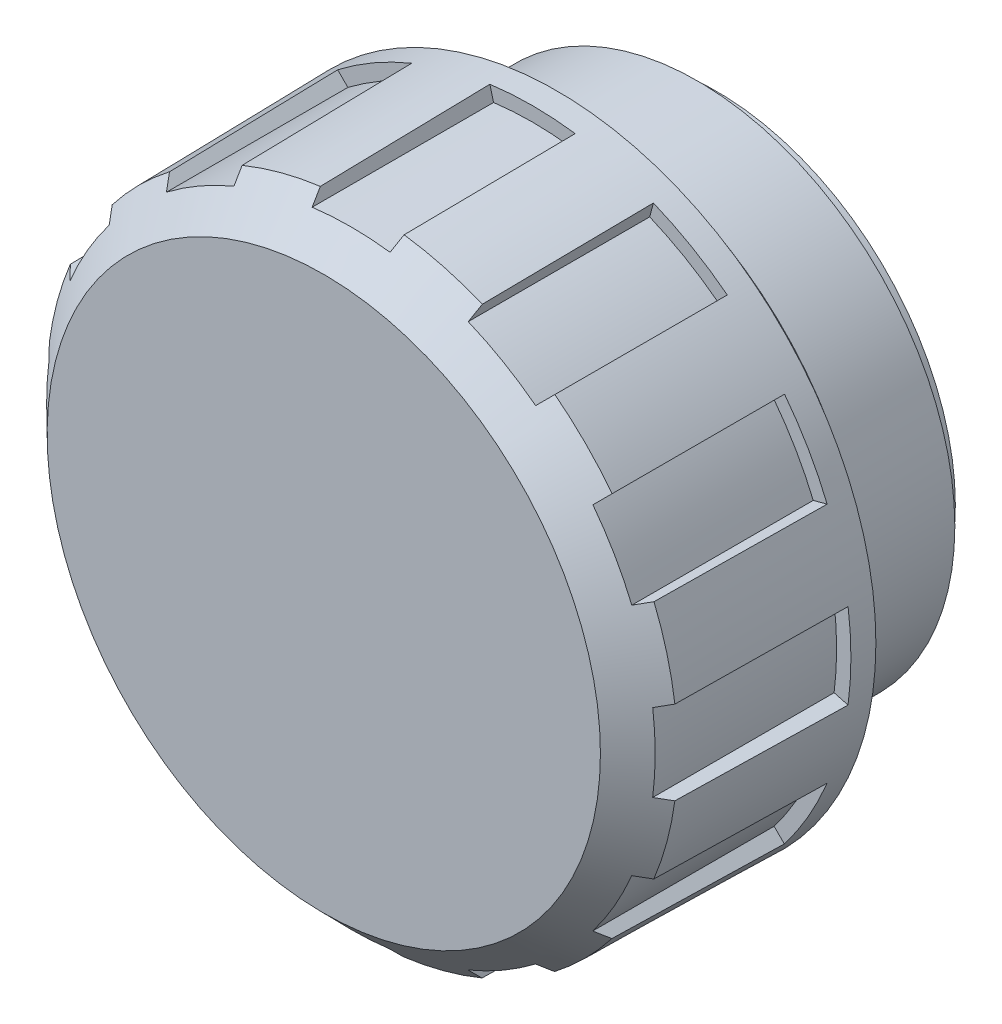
ISO-10303-21;
HEADER;
FILE_DESCRIPTION(('STEP AP214'),'2;1');
FILE_NAME('part.step','',(''),(''),'','','');
FILE_SCHEMA(('AUTOMOTIVE_DESIGN { 1 0 10303 214 1 1 1 1 }'));
ENDSEC;
DATA;
#1=APPLICATION_CONTEXT('core data for automotive mechanical design processes');
#2=APPLICATION_PROTOCOL_DEFINITION('international standard','automotive_design',2000,#1);
#3=PRODUCT_CONTEXT('',#1,'mechanical');
#4=PRODUCT('Part','Part','',(#3));
#5=PRODUCT_RELATED_PRODUCT_CATEGORY('part','',(#4));
#6=PRODUCT_DEFINITION_FORMATION('','',#4);
#7=PRODUCT_DEFINITION_CONTEXT('part definition',#1,'design');
#8=PRODUCT_DEFINITION('design','',#6,#7);
#9=PRODUCT_DEFINITION_SHAPE('','',#8);
#10=(LENGTH_UNIT() NAMED_UNIT(*) SI_UNIT(.MILLI.,.METRE.));
#11=(NAMED_UNIT(*) PLANE_ANGLE_UNIT() SI_UNIT($,.RADIAN.));
#12=(NAMED_UNIT(*) SI_UNIT($,.STERADIAN.) SOLID_ANGLE_UNIT());
#13=UNCERTAINTY_MEASURE_WITH_UNIT(LENGTH_MEASURE(1.E-05),#10,'distance_accuracy_value','');
#14=(GEOMETRIC_REPRESENTATION_CONTEXT(3) GLOBAL_UNCERTAINTY_ASSIGNED_CONTEXT((#13)) GLOBAL_UNIT_ASSIGNED_CONTEXT((#10,
#11,#12)) REPRESENTATION_CONTEXT('',''));
#15=CARTESIAN_POINT('',(0.,0.,0.));
#16=DIRECTION('',(0.,0.,1.));
#17=DIRECTION('',(1.,0.,0.));
#18=AXIS2_PLACEMENT_3D('',#15,#16,#17);
#19=CARTESIAN_POINT('',(0.,0.,2.));
#20=DIRECTION('',(0.,0.,-1.));
#21=DIRECTION('',(-1.,0.,0.));
#22=AXIS2_PLACEMENT_3D('',#19,#20,#21);
#23=CONICAL_SURFACE('',#22,26.,0.0174532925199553);
#24=CARTESIAN_POINT('',(0.,0.,4.));
#25=DIRECTION('',(0.,0.,1.));
#26=DIRECTION('',(1.,0.,0.));
#27=AXIS2_PLACEMENT_3D('',#24,#25,#26);
#28=CIRCLE('',#27,25.9650898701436);
#29=CARTESIAN_POINT('',(3.49226155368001,25.7291663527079,4.));
#30=VERTEX_POINT('',#29);
#31=CARTESIAN_POINT('',(-3.46415246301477,25.7329660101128,4.));
#32=VERTEX_POINT('',#31);
#33=EDGE_CURVE('E713',#30,#32,#28,.T.);
#34=ORIENTED_EDGE('',*,*,#33,.F.);
#35=CARTESIAN_POINT('',(3.42903966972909,25.4932190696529,17.8806751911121));
#36=CARTESIAN_POINT('',(3.43957761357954,25.53254721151,15.5671960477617));
#37=CARTESIAN_POINT('',(3.45011515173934,25.5718738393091,13.2537168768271));
#38=CARTESIAN_POINT('',(3.47118941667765,25.6505240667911,8.62675847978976));
#39=CARTESIAN_POINT('',(3.48172614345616,25.6898476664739,6.31327925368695));
#40=CARTESIAN_POINT('',(3.49226246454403,25.7291697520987,3.9998));
#41=B_SPLINE_CURVE_WITH_KNOTS('',3,(#35,#36,#37,#38,#39,#40),.UNSPECIFIED.,.F.,.F.,(4,2,4),(0.,
6.94151218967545,13.8830243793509),.UNSPECIFIED.);
#42=CARTESIAN_POINT('',(3.42904058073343,25.4932224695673,17.8804751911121));
#43=VERTEX_POINT('',#42);
#44=EDGE_CURVE('E1327',#43,#30,#41,.T.);
#45=ORIENTED_EDGE('',*,*,#44,.F.);
#46=CARTESIAN_POINT('',(0.,0.,17.8804751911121));
#47=DIRECTION('',(0.,0.,1.));
#48=DIRECTION('',(1.,0.,0.));
#49=AXIS2_PLACEMENT_3D('',#46,#47,#48);
#50=CIRCLE('',#49,25.722805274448);
#51=CARTESIAN_POINT('',(9.80320906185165,23.781501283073,17.8804751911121));
#52=VERTEX_POINT('',#51);
#53=EDGE_CURVE('E660',#52,#43,#50,.T.);
#54=ORIENTED_EDGE('',*,*,#53,.F.);
#55=CARTESIAN_POINT('',(9.86643988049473,24.0174819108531,3.9998));
#56=CARTESIAN_POINT('',(9.85590208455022,23.9781543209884,6.31327925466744));
#57=CARTESIAN_POINT('',(9.84536387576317,23.9388251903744,8.6267584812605));
#58=CARTESIAN_POINT('',(9.82428663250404,23.8601638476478,13.2537168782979));
#59=CARTESIAN_POINT('',(9.81374759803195,23.8208316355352,15.5671960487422));
#60=CARTESIAN_POINT('',(9.80320815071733,23.7814978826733,17.8806751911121));
#61=B_SPLINE_CURVE_WITH_KNOTS('',3,(#55,#56,#57,#58,#59,#60),.UNSPECIFIED.,.F.,.F.,(4,2,4),(0.,
6.94151249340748,13.883024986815),.UNSPECIFIED.);
#62=CARTESIAN_POINT('',(9.86643896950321,24.0174785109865,4.));
#63=VERTEX_POINT('',#62);
#64=EDGE_CURVE('E1325',#63,#52,#61,.T.);
#65=ORIENTED_EDGE('',*,*,#64,.F.);
#66=CARTESIAN_POINT('',(15.8889703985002,20.5359809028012,4.));
#67=VERTEX_POINT('',#66);
#68=EDGE_CURVE('E23',#67,#63,#28,.T.);
#69=ORIENTED_EDGE('',*,*,#68,.F.);
#70=CARTESIAN_POINT('',(15.7162449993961,20.3632555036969,17.8806751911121));
#71=CARTESIAN_POINT('',(15.7450351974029,20.3920457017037,15.5671960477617));
#72=CARTESIAN_POINT('',(15.7738242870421,20.420834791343,13.2537168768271));
#73=CARTESIAN_POINT('',(15.8314002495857,20.4784107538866,8.62675847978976));
#74=CARTESIAN_POINT('',(15.8601871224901,20.507197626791,6.31327925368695));
#75=CARTESIAN_POINT('',(15.888972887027,20.5359833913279,3.9998));
#76=B_SPLINE_CURVE_WITH_KNOTS('',3,(#70,#71,#72,#73,#74,#75),.UNSPECIFIED.,.F.,.F.,(4,2,4),(0.,
6.94151218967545,13.8830243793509),.UNSPECIFIED.);
#77=CARTESIAN_POINT('',(15.7162474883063,20.363257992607,17.8804751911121));
#78=VERTEX_POINT('',#77);
#79=EDGE_CURVE('E1322',#78,#67,#76,.T.);
#80=ORIENTED_EDGE('',*,*,#79,.F.);
#81=CARTESIAN_POINT('',(20.3805787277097,15.6937797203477,17.8804751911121));
#82=VERTEX_POINT('',#81);
#83=EDGE_CURVE('E663',#82,#78,#50,.T.);
#84=ORIENTED_EDGE('',*,*,#83,.F.);
#85=CARTESIAN_POINT('',(20.5533285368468,15.8665295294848,3.9998));
#86=CARTESIAN_POINT('',(20.5245387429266,15.8377397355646,6.31327925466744));
#87=CARTESIAN_POINT('',(20.4957478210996,15.8089488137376,8.6267584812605));
#88=CARTESIAN_POINT('',(20.4381637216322,15.7513647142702,13.2537168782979));
#89=CARTESIAN_POINT('',(20.4093705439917,15.7225715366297,15.5671960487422));
#90=CARTESIAN_POINT('',(20.3805762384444,15.6937772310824,17.8806751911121));
#91=B_SPLINE_CURVE_WITH_KNOTS('',3,(#85,#86,#87,#88,#89,#90),.UNSPECIFIED.,.F.,.F.,(4,2,4),(0.,
6.94151249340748,13.883024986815),.UNSPECIFIED.);
#92=CARTESIAN_POINT('',(20.5533260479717,15.8665270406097,4.));
#93=VERTEX_POINT('',#92);
#94=EDGE_CURVE('E1320',#93,#82,#91,.T.);
#95=ORIENTED_EDGE('',*,*,#94,.F.);
#96=CARTESIAN_POINT('',(24.0282424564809,9.84019595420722,4.));
#97=VERTEX_POINT('',#96);
#98=EDGE_CURVE('E9',#97,#93,#28,.T.);
#99=ORIENTED_EDGE('',*,*,#98,.F.);
#100=CARTESIAN_POINT('',(23.7922951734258,9.77697407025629,17.8806751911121));
#101=CARTESIAN_POINT('',(23.831623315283,9.78751201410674,15.5671960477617));
#102=CARTESIAN_POINT('',(23.8709499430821,9.79804955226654,13.2537168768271));
#103=CARTESIAN_POINT('',(23.9496001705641,9.81912381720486,8.62675847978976));
#104=CARTESIAN_POINT('',(23.988923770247,9.82966054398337,6.31327925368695));
#105=CARTESIAN_POINT('',(24.0282458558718,9.84019686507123,3.9998));
#106=B_SPLINE_CURVE_WITH_KNOTS('',3,(#100,#101,#102,#103,#104,#105),.UNSPECIFIED.,.F.,.F.,(4,2,
4),(0.,6.94151218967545,13.8830243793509),.UNSPECIFIED.);
#107=CARTESIAN_POINT('',(23.7922985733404,9.77697498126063,17.8804751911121));
#108=VERTEX_POINT('',#107);
#109=EDGE_CURVE('E1329',#108,#97,#106,.T.);
#110=ORIENTED_EDGE('',*,*,#109,.F.);
#111=CARTESIAN_POINT('',(25.4969887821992,3.40092255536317,17.8804751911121));
#112=VERTEX_POINT('',#111);
#113=EDGE_CURVE('E1303',#112,#108,#50,.T.);
#114=ORIENTED_EDGE('',*,*,#113,.F.);
#115=CARTESIAN_POINT('',(25.7329694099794,3.46415337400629,3.9998));
#116=CARTESIAN_POINT('',(25.6936418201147,3.45361557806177,6.31327925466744));
#117=CARTESIAN_POINT('',(25.6543126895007,3.44307736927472,8.6267584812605));
#118=CARTESIAN_POINT('',(25.5756513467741,3.42200012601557,13.2537168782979));
#119=CARTESIAN_POINT('',(25.5363191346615,3.41146109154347,15.5671960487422));
#120=CARTESIAN_POINT('',(25.4969853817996,3.40092164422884,17.8806751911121));
#121=B_SPLINE_CURVE_WITH_KNOTS('',3,(#115,#116,#117,#118,#119,#120),.UNSPECIFIED.,.F.,.F.,(4,2,
4),(0.,6.94151249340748,13.883024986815),.UNSPECIFIED.);
#122=CARTESIAN_POINT('',(25.7329660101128,3.46415246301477,4.));
#123=VERTEX_POINT('',#122);
#124=EDGE_CURVE('E1434',#123,#112,#121,.T.);
#125=ORIENTED_EDGE('',*,*,#124,.F.);
#126=CARTESIAN_POINT('',(25.7291663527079,-3.49226155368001,4.));
#127=VERTEX_POINT('',#126);
#128=EDGE_CURVE('E18',#127,#123,#28,.T.);
#129=ORIENTED_EDGE('',*,*,#128,.F.);
#130=CARTESIAN_POINT('',(25.4932190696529,-3.42903966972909,17.8806751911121));
#131=CARTESIAN_POINT('',(25.53254721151,-3.43957761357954,15.5671960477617));
#132=CARTESIAN_POINT('',(25.5718738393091,-3.45011515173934,13.2537168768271));
#133=CARTESIAN_POINT('',(25.6505240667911,-3.47118941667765,8.62675847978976));
#134=CARTESIAN_POINT('',(25.6898476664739,-3.48172614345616,6.31327925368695));
#135=CARTESIAN_POINT('',(25.7291697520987,-3.49226246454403,3.9998));
#136=B_SPLINE_CURVE_WITH_KNOTS('',3,(#130,#131,#132,#133,#134,#135),.UNSPECIFIED.,.F.,.F.,(4,2,
4),(0.,6.94151218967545,13.8830243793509),.UNSPECIFIED.);
#137=CARTESIAN_POINT('',(25.4932224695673,-3.42904058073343,17.8804751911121));
#138=VERTEX_POINT('',#137);
#139=EDGE_CURVE('E1439',#138,#127,#136,.T.);
#140=ORIENTED_EDGE('',*,*,#139,.F.);
#141=CARTESIAN_POINT('',(23.781501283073,-9.80320906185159,17.8804751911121));
#142=VERTEX_POINT('',#141);
#143=EDGE_CURVE('E1298',#142,#138,#50,.T.);
#144=ORIENTED_EDGE('',*,*,#143,.F.);
#145=CARTESIAN_POINT('',(24.0174819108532,-9.86643988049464,3.9998));
#146=CARTESIAN_POINT('',(23.9781543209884,-9.85590208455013,6.31327925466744));
#147=CARTESIAN_POINT('',(23.9388251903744,-9.84536387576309,8.6267584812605));
#148=CARTESIAN_POINT('',(23.8601638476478,-9.82428663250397,13.2537168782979));
#149=CARTESIAN_POINT('',(23.8208316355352,-9.81374759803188,15.5671960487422));
#150=CARTESIAN_POINT('',(23.7814978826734,-9.80320815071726,17.8806751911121));
#151=B_SPLINE_CURVE_WITH_KNOTS('',3,(#145,#146,#147,#148,#149,#150),.UNSPECIFIED.,.F.,.F.,(4,2,
4),(0.,6.94151249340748,13.883024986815),.UNSPECIFIED.);
#152=CARTESIAN_POINT('',(24.0174785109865,-9.86643896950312,4.));
#153=VERTEX_POINT('',#152);
#154=EDGE_CURVE('E1441',#153,#142,#151,.T.);
#155=ORIENTED_EDGE('',*,*,#154,.F.);
#156=CARTESIAN_POINT('',(20.5359809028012,-15.8889703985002,4.));
#157=VERTEX_POINT('',#156);
#158=EDGE_CURVE('E1415',#157,#153,#28,.T.);
#159=ORIENTED_EDGE('',*,*,#158,.F.);
#160=CARTESIAN_POINT('',(20.3632555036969,-15.7162449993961,17.8806751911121));
#161=CARTESIAN_POINT('',(20.3920457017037,-15.7450351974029,15.5671960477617));
#162=CARTESIAN_POINT('',(20.420834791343,-15.7738242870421,13.2537168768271));
#163=CARTESIAN_POINT('',(20.4784107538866,-15.8314002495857,8.62675847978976));
#164=CARTESIAN_POINT('',(20.507197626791,-15.8601871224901,6.31327925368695));
#165=CARTESIAN_POINT('',(20.5359833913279,-15.888972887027,3.9998));
#166=B_SPLINE_CURVE_WITH_KNOTS('',3,(#160,#161,#162,#163,#164,#165),.UNSPECIFIED.,.F.,.F.,(4,2,
4),(0.,6.94151218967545,13.8830243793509),.UNSPECIFIED.);
#167=CARTESIAN_POINT('',(20.363257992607,-15.7162474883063,17.8804751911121));
#168=VERTEX_POINT('',#167);
#169=EDGE_CURVE('E1469',#168,#157,#166,.T.);
#170=ORIENTED_EDGE('',*,*,#169,.F.);
#171=CARTESIAN_POINT('',(15.6937797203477,-20.3805787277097,17.8804751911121));
#172=VERTEX_POINT('',#171);
#173=EDGE_CURVE('E1293',#172,#168,#50,.T.);
#174=ORIENTED_EDGE('',*,*,#173,.F.);
#175=CARTESIAN_POINT('',(15.8665295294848,-20.5533285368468,3.9998));
#176=CARTESIAN_POINT('',(15.8377397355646,-20.5245387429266,6.31327925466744));
#177=CARTESIAN_POINT('',(15.8089488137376,-20.4957478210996,8.6267584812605));
#178=CARTESIAN_POINT('',(15.7513647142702,-20.4381637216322,13.2537168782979));
#179=CARTESIAN_POINT('',(15.7225715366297,-20.4093705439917,15.5671960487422));
#180=CARTESIAN_POINT('',(15.6937772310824,-20.3805762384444,17.8806751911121));
#181=B_SPLINE_CURVE_WITH_KNOTS('',3,(#175,#176,#177,#178,#179,#180),.UNSPECIFIED.,.F.,.F.,(4,2,
4),(0.,6.94151249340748,13.883024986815),.UNSPECIFIED.);
#182=CARTESIAN_POINT('',(15.8665270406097,-20.5533260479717,4.));
#183=VERTEX_POINT('',#182);
#184=EDGE_CURVE('E1475',#183,#172,#181,.T.);
#185=ORIENTED_EDGE('',*,*,#184,.F.);
#186=CARTESIAN_POINT('',(9.84019595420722,-24.0282424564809,4.));
#187=VERTEX_POINT('',#186);
#188=EDGE_CURVE('E1410',#187,#183,#28,.T.);
#189=ORIENTED_EDGE('',*,*,#188,.F.);
#190=CARTESIAN_POINT('',(9.77697407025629,-23.7922951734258,17.8806751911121));
#191=CARTESIAN_POINT('',(9.78751201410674,-23.831623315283,15.5671960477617));
#192=CARTESIAN_POINT('',(9.79804955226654,-23.8709499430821,13.2537168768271));
#193=CARTESIAN_POINT('',(9.81912381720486,-23.9496001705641,8.62675847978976));
#194=CARTESIAN_POINT('',(9.82966054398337,-23.988923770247,6.31327925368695));
#195=CARTESIAN_POINT('',(9.84019686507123,-24.0282458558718,3.9998));
#196=B_SPLINE_CURVE_WITH_KNOTS('',3,(#190,#191,#192,#193,#194,#195),.UNSPECIFIED.,.F.,.F.,(4,2,
4),(0.,6.94151218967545,13.8830243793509),.UNSPECIFIED.);
#197=CARTESIAN_POINT('',(9.77697498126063,-23.7922985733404,17.8804751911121));
#198=VERTEX_POINT('',#197);
#199=EDGE_CURVE('E1488',#198,#187,#196,.T.);
#200=ORIENTED_EDGE('',*,*,#199,.F.);
#201=CARTESIAN_POINT('',(3.40092255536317,-25.4969887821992,17.8804751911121));
#202=VERTEX_POINT('',#201);
#203=EDGE_CURVE('E1288',#202,#198,#50,.T.);
#204=ORIENTED_EDGE('',*,*,#203,.F.);
#205=CARTESIAN_POINT('',(3.46415337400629,-25.7329694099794,3.9998));
#206=CARTESIAN_POINT('',(3.45361557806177,-25.6936418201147,6.31327925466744));
#207=CARTESIAN_POINT('',(3.44307736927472,-25.6543126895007,8.6267584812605));
#208=CARTESIAN_POINT('',(3.42200012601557,-25.5756513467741,13.2537168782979));
#209=CARTESIAN_POINT('',(3.41146109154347,-25.5363191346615,15.5671960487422));
#210=CARTESIAN_POINT('',(3.40092164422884,-25.4969853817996,17.8806751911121));
#211=B_SPLINE_CURVE_WITH_KNOTS('',3,(#205,#206,#207,#208,#209,#210),.UNSPECIFIED.,.F.,.F.,(4,2,
4),(0.,6.94151249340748,13.883024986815),.UNSPECIFIED.);
#212=CARTESIAN_POINT('',(3.46415246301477,-25.7329660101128,4.));
#213=VERTEX_POINT('',#212);
#214=EDGE_CURVE('E1494',#213,#202,#211,.T.);
#215=ORIENTED_EDGE('',*,*,#214,.F.);
#216=CARTESIAN_POINT('',(-3.49226155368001,-25.7291663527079,4.));
#217=VERTEX_POINT('',#216);
#218=EDGE_CURVE('E1405',#217,#213,#28,.T.);
#219=ORIENTED_EDGE('',*,*,#218,.F.);
#220=CARTESIAN_POINT('',(-3.42903966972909,-25.4932190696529,17.8806751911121));
#221=CARTESIAN_POINT('',(-3.43957761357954,-25.53254721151,15.5671960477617));
#222=CARTESIAN_POINT('',(-3.45011515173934,-25.5718738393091,13.2537168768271));
#223=CARTESIAN_POINT('',(-3.47118941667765,-25.6505240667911,8.62675847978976));
#224=CARTESIAN_POINT('',(-3.48172614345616,-25.6898476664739,6.31327925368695));
#225=CARTESIAN_POINT('',(-3.49226246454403,-25.7291697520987,3.9998));
#226=B_SPLINE_CURVE_WITH_KNOTS('',3,(#220,#221,#222,#223,#224,#225),.UNSPECIFIED.,.F.,.F.,(4,2,
4),(0.,6.94151218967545,13.8830243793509),.UNSPECIFIED.);
#227=CARTESIAN_POINT('',(-3.42904058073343,-25.4932224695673,17.8804751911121));
#228=VERTEX_POINT('',#227);
#229=EDGE_CURVE('E1500',#228,#217,#226,.T.);
#230=ORIENTED_EDGE('',*,*,#229,.F.);
#231=CARTESIAN_POINT('',(-9.80320906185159,-23.781501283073,17.8804751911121));
#232=VERTEX_POINT('',#231);
#233=EDGE_CURVE('E1283',#232,#228,#50,.T.);
#234=ORIENTED_EDGE('',*,*,#233,.F.);
#235=CARTESIAN_POINT('',(-9.86643988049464,-24.0174819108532,3.9998));
#236=CARTESIAN_POINT('',(-9.85590208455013,-23.9781543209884,6.31327925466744));
#237=CARTESIAN_POINT('',(-9.84536387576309,-23.9388251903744,8.6267584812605));
#238=CARTESIAN_POINT('',(-9.82428663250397,-23.8601638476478,13.2537168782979));
#239=CARTESIAN_POINT('',(-9.81374759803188,-23.8208316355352,15.5671960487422));
#240=CARTESIAN_POINT('',(-9.80320815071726,-23.7814978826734,17.8806751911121));
#241=B_SPLINE_CURVE_WITH_KNOTS('',3,(#235,#236,#237,#238,#239,#240),.UNSPECIFIED.,.F.,.F.,(4,2,
4),(0.,6.94151249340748,13.883024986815),.UNSPECIFIED.);
#242=CARTESIAN_POINT('',(-9.86643896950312,-24.0174785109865,4.));
#243=VERTEX_POINT('',#242);
#244=EDGE_CURVE('E1506',#243,#232,#241,.T.);
#245=ORIENTED_EDGE('',*,*,#244,.F.);
#246=CARTESIAN_POINT('',(-15.8889703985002,-20.5359809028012,4.));
#247=VERTEX_POINT('',#246);
#248=EDGE_CURVE('E1401',#247,#243,#28,.T.);
#249=ORIENTED_EDGE('',*,*,#248,.F.);
#250=CARTESIAN_POINT('',(-15.7162449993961,-20.3632555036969,17.8806751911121));
#251=CARTESIAN_POINT('',(-15.7450351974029,-20.3920457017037,15.5671960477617));
#252=CARTESIAN_POINT('',(-15.7738242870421,-20.420834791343,13.2537168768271));
#253=CARTESIAN_POINT('',(-15.8314002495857,-20.4784107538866,8.62675847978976));
#254=CARTESIAN_POINT('',(-15.8601871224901,-20.507197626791,6.31327925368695));
#255=CARTESIAN_POINT('',(-15.888972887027,-20.5359833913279,3.9998));
#256=B_SPLINE_CURVE_WITH_KNOTS('',3,(#250,#251,#252,#253,#254,#255),.UNSPECIFIED.,.F.,.F.,(4,2,
4),(0.,6.94151218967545,13.8830243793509),.UNSPECIFIED.);
#257=CARTESIAN_POINT('',(-15.7162474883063,-20.363257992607,17.8804751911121));
#258=VERTEX_POINT('',#257);
#259=EDGE_CURVE('E1518',#258,#247,#256,.T.);
#260=ORIENTED_EDGE('',*,*,#259,.F.);
#261=CARTESIAN_POINT('',(-20.3805787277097,-15.6937797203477,17.8804751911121));
#262=VERTEX_POINT('',#261);
#263=EDGE_CURVE('E1279',#262,#258,#50,.T.);
#264=ORIENTED_EDGE('',*,*,#263,.F.);
#265=CARTESIAN_POINT('',(-20.5533285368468,-15.8665295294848,3.9998));
#266=CARTESIAN_POINT('',(-20.5245387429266,-15.8377397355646,6.31327925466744));
#267=CARTESIAN_POINT('',(-20.4957478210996,-15.8089488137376,8.6267584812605));
#268=CARTESIAN_POINT('',(-20.4381637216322,-15.7513647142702,13.2537168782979));
#269=CARTESIAN_POINT('',(-20.4093705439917,-15.7225715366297,15.5671960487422));
#270=CARTESIAN_POINT('',(-20.3805762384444,-15.6937772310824,17.8806751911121));
#271=B_SPLINE_CURVE_WITH_KNOTS('',3,(#265,#266,#267,#268,#269,#270),.UNSPECIFIED.,.F.,.F.,(4,2,
4),(0.,6.94151249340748,13.883024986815),.UNSPECIFIED.);
#272=CARTESIAN_POINT('',(-20.5533260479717,-15.8665270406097,4.));
#273=VERTEX_POINT('',#272);
#274=EDGE_CURVE('E406',#273,#262,#271,.T.);
#275=ORIENTED_EDGE('',*,*,#274,.F.);
#276=CARTESIAN_POINT('',(-24.0282424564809,-9.84019595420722,4.));
#277=VERTEX_POINT('',#276);
#278=EDGE_CURVE('E1399',#277,#273,#28,.T.);
#279=ORIENTED_EDGE('',*,*,#278,.F.);
#280=CARTESIAN_POINT('',(-23.7922951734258,-9.77697407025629,17.8806751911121));
#281=CARTESIAN_POINT('',(-23.831623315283,-9.78751201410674,15.5671960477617));
#282=CARTESIAN_POINT('',(-23.8709499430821,-9.79804955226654,13.2537168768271));
#283=CARTESIAN_POINT('',(-23.9496001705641,-9.81912381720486,8.62675847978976));
#284=CARTESIAN_POINT('',(-23.988923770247,-9.82966054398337,6.31327925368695));
#285=CARTESIAN_POINT('',(-24.0282458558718,-9.84019686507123,3.9998));
#286=B_SPLINE_CURVE_WITH_KNOTS('',3,(#280,#281,#282,#283,#284,#285),.UNSPECIFIED.,.F.,.F.,(4,2,
4),(0.,6.94151218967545,13.8830243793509),.UNSPECIFIED.);
#287=CARTESIAN_POINT('',(-23.7922985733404,-9.77697498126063,17.8804751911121));
#288=VERTEX_POINT('',#287);
#289=EDGE_CURVE('E397',#288,#277,#286,.T.);
#290=ORIENTED_EDGE('',*,*,#289,.F.);
#291=CARTESIAN_POINT('',(-25.4969887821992,-3.40092255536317,17.8804751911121));
#292=VERTEX_POINT('',#291);
#293=EDGE_CURVE('E1275',#292,#288,#50,.T.);
#294=ORIENTED_EDGE('',*,*,#293,.F.);
#295=CARTESIAN_POINT('',(-25.7329694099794,-3.46415337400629,3.9998));
#296=CARTESIAN_POINT('',(-25.6936418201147,-3.45361557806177,6.31327925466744));
#297=CARTESIAN_POINT('',(-25.6543126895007,-3.44307736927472,8.6267584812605));
#298=CARTESIAN_POINT('',(-25.5756513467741,-3.42200012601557,13.2537168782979));
#299=CARTESIAN_POINT('',(-25.5363191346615,-3.41146109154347,15.5671960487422));
#300=CARTESIAN_POINT('',(-25.4969853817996,-3.40092164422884,17.8806751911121));
#301=B_SPLINE_CURVE_WITH_KNOTS('',3,(#295,#296,#297,#298,#299,#300),.UNSPECIFIED.,.F.,.F.,(4,2,
4),(0.,6.94151249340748,13.883024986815),.UNSPECIFIED.);
#302=CARTESIAN_POINT('',(-25.7329660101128,-3.46415246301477,4.));
#303=VERTEX_POINT('',#302);
#304=EDGE_CURVE('E645',#303,#292,#301,.T.);
#305=ORIENTED_EDGE('',*,*,#304,.F.);
#306=CARTESIAN_POINT('',(-25.7291663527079,3.49226155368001,4.));
#307=VERTEX_POINT('',#306);
#308=EDGE_CURVE('E1397',#307,#303,#28,.T.);
#309=ORIENTED_EDGE('',*,*,#308,.F.);
#310=CARTESIAN_POINT('',(-25.4932190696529,3.42903966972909,17.8806751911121));
#311=CARTESIAN_POINT('',(-25.53254721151,3.43957761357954,15.5671960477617));
#312=CARTESIAN_POINT('',(-25.5718738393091,3.45011515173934,13.2537168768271));
#313=CARTESIAN_POINT('',(-25.6505240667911,3.47118941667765,8.62675847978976));
#314=CARTESIAN_POINT('',(-25.6898476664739,3.48172614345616,6.31327925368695));
#315=CARTESIAN_POINT('',(-25.7291697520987,3.49226246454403,3.9998));
#316=B_SPLINE_CURVE_WITH_KNOTS('',3,(#310,#311,#312,#313,#314,#315),.UNSPECIFIED.,.F.,.F.,(4,2,
4),(0.,6.94151218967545,13.8830243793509),.UNSPECIFIED.);
#317=CARTESIAN_POINT('',(-25.4932224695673,3.42904058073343,17.8804751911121));
#318=VERTEX_POINT('',#317);
#319=EDGE_CURVE('E320',#318,#307,#316,.T.);
#320=ORIENTED_EDGE('',*,*,#319,.F.);
#321=CARTESIAN_POINT('',(-23.781501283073,9.80320906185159,17.8804751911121));
#322=VERTEX_POINT('',#321);
#323=EDGE_CURVE('E1278',#322,#318,#50,.T.);
#324=ORIENTED_EDGE('',*,*,#323,.F.);
#325=CARTESIAN_POINT('',(-24.0174819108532,9.86643988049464,3.9998));
#326=CARTESIAN_POINT('',(-23.9781543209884,9.85590208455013,6.31327925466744));
#327=CARTESIAN_POINT('',(-23.9388251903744,9.84536387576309,8.6267584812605));
#328=CARTESIAN_POINT('',(-23.8601638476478,9.82428663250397,13.2537168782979));
#329=CARTESIAN_POINT('',(-23.8208316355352,9.81374759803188,15.5671960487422));
#330=CARTESIAN_POINT('',(-23.7814978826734,9.80320815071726,17.8806751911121));
#331=B_SPLINE_CURVE_WITH_KNOTS('',3,(#325,#326,#327,#328,#329,#330),.UNSPECIFIED.,.F.,.F.,(4,2,
4),(0.,6.94151249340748,13.883024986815),.UNSPECIFIED.);
#332=CARTESIAN_POINT('',(-24.0174785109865,9.86643896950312,4.));
#333=VERTEX_POINT('',#332);
#334=EDGE_CURVE('E646',#333,#322,#331,.T.);
#335=ORIENTED_EDGE('',*,*,#334,.F.);
#336=CARTESIAN_POINT('',(-20.5359809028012,15.8889703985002,4.));
#337=VERTEX_POINT('',#336);
#338=EDGE_CURVE('E1398',#337,#333,#28,.T.);
#339=ORIENTED_EDGE('',*,*,#338,.F.);
#340=CARTESIAN_POINT('',(-20.3632555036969,15.7162449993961,17.8806751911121));
#341=CARTESIAN_POINT('',(-20.3920457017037,15.7450351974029,15.5671960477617));
#342=CARTESIAN_POINT('',(-20.420834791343,15.7738242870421,13.2537168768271));
#343=CARTESIAN_POINT('',(-20.4784107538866,15.8314002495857,8.62675847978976));
#344=CARTESIAN_POINT('',(-20.507197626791,15.8601871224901,6.31327925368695));
#345=CARTESIAN_POINT('',(-20.5359833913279,15.888972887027,3.9998));
#346=B_SPLINE_CURVE_WITH_KNOTS('',3,(#340,#341,#342,#343,#344,#345),.UNSPECIFIED.,.F.,.F.,(4,2,
4),(0.,6.94151218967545,13.8830243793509),.UNSPECIFIED.);
#347=CARTESIAN_POINT('',(-20.363257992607,15.7162474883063,17.8804751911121));
#348=VERTEX_POINT('',#347);
#349=EDGE_CURVE('E1381',#348,#337,#346,.T.);
#350=ORIENTED_EDGE('',*,*,#349,.F.);
#351=CARTESIAN_POINT('',(-15.6937797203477,20.3805787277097,17.8804751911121));
#352=VERTEX_POINT('',#351);
#353=EDGE_CURVE('E1281',#352,#348,#50,.T.);
#354=ORIENTED_EDGE('',*,*,#353,.F.);
#355=CARTESIAN_POINT('',(-15.8665295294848,20.5533285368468,3.9998));
#356=CARTESIAN_POINT('',(-15.8377397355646,20.5245387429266,6.31327925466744));
#357=CARTESIAN_POINT('',(-15.8089488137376,20.4957478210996,8.6267584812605));
#358=CARTESIAN_POINT('',(-15.7513647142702,20.4381637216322,13.2537168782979));
#359=CARTESIAN_POINT('',(-15.7225715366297,20.4093705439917,15.5671960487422));
#360=CARTESIAN_POINT('',(-15.6937772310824,20.3805762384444,17.8806751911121));
#361=B_SPLINE_CURVE_WITH_KNOTS('',3,(#355,#356,#357,#358,#359,#360),.UNSPECIFIED.,.F.,.F.,(4,2,
4),(0.,6.94151249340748,13.883024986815),.UNSPECIFIED.);
#362=CARTESIAN_POINT('',(-15.8665270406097,20.5533260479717,4.));
#363=VERTEX_POINT('',#362);
#364=EDGE_CURVE('E1376',#363,#352,#361,.T.);
#365=ORIENTED_EDGE('',*,*,#364,.F.);
#366=CARTESIAN_POINT('',(-9.84019595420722,24.0282424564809,4.));
#367=VERTEX_POINT('',#366);
#368=EDGE_CURVE('E1400',#367,#363,#28,.T.);
#369=ORIENTED_EDGE('',*,*,#368,.F.);
#370=CARTESIAN_POINT('',(-9.77697407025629,23.7922951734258,17.8806751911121));
#371=CARTESIAN_POINT('',(-9.78751201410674,23.831623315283,15.5671960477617));
#372=CARTESIAN_POINT('',(-9.79804955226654,23.8709499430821,13.2537168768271));
#373=CARTESIAN_POINT('',(-9.81912381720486,23.9496001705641,8.62675847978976));
#374=CARTESIAN_POINT('',(-9.82966054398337,23.988923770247,6.31327925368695));
#375=CARTESIAN_POINT('',(-9.84019686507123,24.0282458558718,3.9998));
#376=B_SPLINE_CURVE_WITH_KNOTS('',3,(#370,#371,#372,#373,#374,#375),.UNSPECIFIED.,.F.,.F.,(4,2,
4),(0.,6.94151218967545,13.8830243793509),.UNSPECIFIED.);
#377=CARTESIAN_POINT('',(-9.77697498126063,23.7922985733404,17.8804751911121));
#378=VERTEX_POINT('',#377);
#379=EDGE_CURVE('E1363',#378,#367,#376,.T.);
#380=ORIENTED_EDGE('',*,*,#379,.F.);
#381=CARTESIAN_POINT('',(-3.40092255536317,25.4969887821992,17.8804751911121));
#382=VERTEX_POINT('',#381);
#383=EDGE_CURVE('E664',#382,#378,#50,.T.);
#384=ORIENTED_EDGE('',*,*,#383,.F.);
#385=CARTESIAN_POINT('',(-3.46415337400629,25.7329694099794,3.9998));
#386=CARTESIAN_POINT('',(-3.45361557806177,25.6936418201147,6.31327925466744));
#387=CARTESIAN_POINT('',(-3.44307736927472,25.6543126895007,8.6267584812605));
#388=CARTESIAN_POINT('',(-3.42200012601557,25.5756513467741,13.2537168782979));
#389=CARTESIAN_POINT('',(-3.41146109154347,25.5363191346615,15.5671960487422));
#390=CARTESIAN_POINT('',(-3.40092164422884,25.4969853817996,17.8806751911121));
#391=B_SPLINE_CURVE_WITH_KNOTS('',3,(#385,#386,#387,#388,#389,#390),.UNSPECIFIED.,.F.,.F.,(4,2,
4),(0.,6.94151249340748,13.883024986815),.UNSPECIFIED.);
#392=EDGE_CURVE('E1357',#32,#382,#391,.T.);
#393=ORIENTED_EDGE('',*,*,#392,.F.);
#394=EDGE_LOOP('',(#34,#45,#54,#65,#69,#80,#84,#95,#99,#110,#114,#125,#129,#140,#144,#155,#159,
#170,#174,#185,#189,#200,#204,#215,#219,#230,#234,#245,#249,#260,#264,#275,#279,#290,#294,#305,
#309,#320,#324,#335,#339,#350,#354,#365,#369,#380,#384,#393));
#395=FACE_BOUND('',#394,.T.);
#396=CARTESIAN_POINT('',(0.,0.,2.));
#397=DIRECTION('',(0.,0.,1.));
#398=DIRECTION('',(1.,0.,0.));
#399=AXIS2_PLACEMENT_3D('',#396,#397,#398);
#400=CIRCLE('',#399,26.);
#401=CARTESIAN_POINT('',(26.,0.,2.));
#402=VERTEX_POINT('',#401);
#403=EDGE_CURVE('E665',#402,#402,#400,.T.);
#404=ORIENTED_EDGE('',*,*,#403,.T.);
#405=EDGE_LOOP('',(#404));
#406=FACE_BOUND('',#405,.T.);
#407=ADVANCED_FACE('F14',(#395,#406),#23,.T.);
#408=CARTESIAN_POINT('',(0.,0.,17.8804751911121));
#409=DIRECTION('',(0.,0.,-1.));
#410=DIRECTION('',(-1.,0.,0.));
#411=AXIS2_PLACEMENT_3D('',#408,#409,#410);
#412=CONICAL_SURFACE('',#411,25.722805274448,0.794124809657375);
#413=CARTESIAN_POINT('',(0.,0.,21.));
#414=DIRECTION('',(0.,0.,1.));
#415=DIRECTION('',(1.,0.,0.));
#416=AXIS2_PLACEMENT_3D('',#413,#414,#415);
#417=CIRCLE('',#416,22.548353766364);
#418=CARTESIAN_POINT('',(22.548353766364,0.,21.));
#419=VERTEX_POINT('',#418);
#420=EDGE_CURVE('E657',#419,#419,#417,.T.);
#421=ORIENTED_EDGE('',*,*,#420,.F.);
#422=EDGE_LOOP('',(#421));
#423=FACE_BOUND('',#422,.T.);
#424=CARTESIAN_POINT('',(-25.4971870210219,-3.40097567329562,17.8802751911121));
#425=CARTESIAN_POINT('',(-25.3472881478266,-3.36081039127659,18.0315066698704));
#426=CARTESIAN_POINT('',(-25.1973775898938,-3.32064197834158,18.1827257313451));
#427=CARTESIAN_POINT('',(-24.8975331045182,-3.24029889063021,18.4851390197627));
#428=CARTESIAN_POINT('',(-24.7475991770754,-3.20012421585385,18.6363332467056));
#429=CARTESIAN_POINT('',(-24.597653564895,-3.15994641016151,18.7875150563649));
#430=B_SPLINE_CURVE_WITH_KNOTS('',3,(#424,#425,#426,#427,#428,#429),.UNSPECIFIED.,.F.,.F.,(4,2,
4),(0.,0.650065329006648,1.30013065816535),.UNSPECIFIED.);
#431=CARTESIAN_POINT('',(-24.597853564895,-3.16,18.7873134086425));
#432=VERTEX_POINT('',#431);
#433=EDGE_CURVE('E1270',#292,#432,#430,.T.);
#434=ORIENTED_EDGE('',*,*,#433,.F.);
#435=ORIENTED_EDGE('',*,*,#293,.T.);
#436=CARTESIAN_POINT('',(-22.893096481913,-9.53603450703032,18.7875150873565));
#437=CARTESIAN_POINT('',(-23.0430194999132,-9.57620625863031,18.6363328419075));
#438=CARTESIAN_POINT('',(-23.1929310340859,-9.61637493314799,18.4851383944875));
#439=CARTESIAN_POINT('',(-23.4927311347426,-9.6967061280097,18.1827250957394));
#440=CARTESIAN_POINT('',(-23.6426197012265,-9.73686864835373,18.0315062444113));
#441=CARTESIAN_POINT('',(-23.7924967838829,-9.77702809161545,17.8802751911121));
#442=B_SPLINE_CURVE_WITH_KNOTS('',3,(#436,#437,#438,#439,#440,#441),.UNSPECIFIED.,.F.,.F.,(4,2,
4),(0.,0.650015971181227,1.30003194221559),.UNSPECIFIED.);
#443=CARTESIAN_POINT('',(-22.893296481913,-9.5360880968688,18.7873134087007));
#444=VERTEX_POINT('',#443);
#445=EDGE_CURVE('E429',#444,#288,#442,.T.);
#446=ORIENTED_EDGE('',*,*,#445,.F.);
#447=CARTESIAN_POINT('',(0.,0.,18.7873134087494));
#448=DIRECTION('',(0.,0.,-1.));
#449=DIRECTION('',(-1.,0.,0.));
#450=AXIS2_PLACEMENT_3D('',#447,#448,#449);
#451=CIRCLE('',#450,24.7999999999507);
#452=CARTESIAN_POINT('',(-19.722366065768,-15.035567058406,18.7873134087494));
#453=VERTEX_POINT('',#452);
#454=EDGE_CURVE('E436',#453,#444,#451,.T.);
#455=ORIENTED_EDGE('',*,*,#454,.F.);
#456=CARTESIAN_POINT('',(-20.3807238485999,-15.693924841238,17.8802751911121));
#457=CARTESIAN_POINT('',(-20.2709813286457,-15.5841823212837,18.0315189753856));
#458=CARTESIAN_POINT('',(-20.161230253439,-15.474431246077,18.182750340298));
#459=CARTESIAN_POINT('',(-19.941710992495,-15.254911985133,18.485188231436));
#460=CARTESIAN_POINT('',(-19.8319428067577,-15.1451437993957,18.6363947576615));
#461=CARTESIAN_POINT('',(-19.722166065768,-15.035367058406,18.7875888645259));
#462=B_SPLINE_CURVE_WITH_KNOTS('',3,(#456,#457,#458,#459,#460,#461),.UNSPECIFIED.,.F.,.F.,(4,2,
4),(0.,0.650118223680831,1.30023644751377),.UNSPECIFIED.);
#463=EDGE_CURVE('E450',#262,#453,#462,.T.);
#464=ORIENTED_EDGE('',*,*,#463,.F.);
#465=ORIENTED_EDGE('',*,*,#263,.T.);
#466=CARTESIAN_POINT('',(-15.057932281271,-19.704942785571,18.7875889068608));
#467=CARTESIAN_POINT('',(-15.167692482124,-19.8147029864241,18.6363943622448));
#468=CARTESIAN_POINT('',(-15.2774442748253,-19.9244547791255,18.4851876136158));
#469=CARTESIAN_POINT('',(-15.4969310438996,-20.1439415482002,18.1827497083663));
#470=CARTESIAN_POINT('',(-15.6066660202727,-20.2536765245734,18.0315185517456));
#471=CARTESIAN_POINT('',(-15.716392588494,-20.3634030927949,17.8802751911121));
#472=B_SPLINE_CURVE_WITH_KNOTS('',3,(#466,#467,#468,#469,#470,#471),.UNSPECIFIED.,.F.,.F.,(4,2,
4),(0.,0.650068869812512,1.30013773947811),.UNSPECIFIED.);
#473=CARTESIAN_POINT('',(-15.058132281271,-19.705142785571,18.787313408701));
#474=VERTEX_POINT('',#473);
#475=EDGE_CURVE('E457',#474,#258,#472,.T.);
#476=ORIENTED_EDGE('',*,*,#475,.F.);
#477=CARTESIAN_POINT('',(0.,0.,18.7873134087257));
#478=DIRECTION('',(0.,0.,-1.));
#479=DIRECTION('',(-1.,0.,0.));
#480=AXIS2_PLACEMENT_3D('',#477,#478,#479);
#481=CIRCLE('',#480,24.7999999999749);
#482=CARTESIAN_POINT('',(-9.56228650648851,-22.882366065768,18.7873134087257));
#483=VERTEX_POINT('',#482);
#484=EDGE_CURVE('E1533',#483,#474,#481,.T.);
#485=ORIENTED_EDGE('',*,*,#484,.F.);
#486=CARTESIAN_POINT('',(-9.80326217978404,-23.7816995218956,17.8802751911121));
#487=CARTESIAN_POINT('',(-9.76309689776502,-23.6318006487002,18.0315066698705));
#488=CARTESIAN_POINT('',(-9.72292848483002,-23.4818900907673,18.1827257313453));
#489=CARTESIAN_POINT('',(-9.64258539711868,-23.1820456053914,18.4851390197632));
#490=CARTESIAN_POINT('',(-9.60241072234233,-23.0321116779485,18.6363332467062));
#491=CARTESIAN_POINT('',(-9.56223291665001,-22.882166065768,18.7875150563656));
#492=B_SPLINE_CURVE_WITH_KNOTS('',3,(#486,#487,#488,#489,#490,#491),.UNSPECIFIED.,.F.,.F.,(4,2,
4),(0.,0.650065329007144,1.30013065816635),.UNSPECIFIED.);
#493=EDGE_CURVE('E466',#232,#483,#492,.T.);
#494=ORIENTED_EDGE('',*,*,#493,.F.);
#495=ORIENTED_EDGE('',*,*,#233,.T.);
#496=CARTESIAN_POINT('',(-3.18810010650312,-24.59402037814,18.7875150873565));
#497=CARTESIAN_POINT('',(-3.2282718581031,-24.7439433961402,18.6363328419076));
#498=CARTESIAN_POINT('',(-3.26844053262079,-24.8938549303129,18.4851383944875));
#499=CARTESIAN_POINT('',(-3.3487717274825,-25.1936550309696,18.1827250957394));
#500=CARTESIAN_POINT('',(-3.38893424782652,-25.3435435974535,18.0315062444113));
#501=CARTESIAN_POINT('',(-3.42909369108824,-25.4934206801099,17.8802751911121));
#502=B_SPLINE_CURVE_WITH_KNOTS('',3,(#496,#497,#498,#499,#500,#501),.UNSPECIFIED.,.F.,.F.,(4,2,
4),(0.,0.650015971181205,1.30003194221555),.UNSPECIFIED.);
#503=CARTESIAN_POINT('',(-3.1881536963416,-24.59422037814,18.7873134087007));
#504=VERTEX_POINT('',#503);
#505=EDGE_CURVE('E474',#504,#228,#502,.T.);
#506=ORIENTED_EDGE('',*,*,#505,.F.);
#507=CARTESIAN_POINT('',(0.,0.,18.7873134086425));
#508=DIRECTION('',(0.,0.,-1.));
#509=DIRECTION('',(-1.,0.,0.));
#510=AXIS2_PLACEMENT_3D('',#507,#508,#509);
#511=CIRCLE('',#510,24.8000000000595);
#512=CARTESIAN_POINT('',(3.16,-24.597853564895,18.7873134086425));
#513=VERTEX_POINT('',#512);
#514=EDGE_CURVE('E1534',#513,#504,#511,.T.);
#515=ORIENTED_EDGE('',*,*,#514,.F.);
#516=CARTESIAN_POINT('',(3.40097567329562,-25.4971870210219,17.8802751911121));
#517=CARTESIAN_POINT('',(3.36081039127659,-25.3472881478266,18.0315066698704));
#518=CARTESIAN_POINT('',(3.32064197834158,-25.1973775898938,18.1827257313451));
#519=CARTESIAN_POINT('',(3.24029889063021,-24.8975331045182,18.4851390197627));
#520=CARTESIAN_POINT('',(3.20012421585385,-24.7475991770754,18.6363332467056));
#521=CARTESIAN_POINT('',(3.15994641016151,-24.597653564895,18.7875150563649));
#522=B_SPLINE_CURVE_WITH_KNOTS('',3,(#516,#517,#518,#519,#520,#521),.UNSPECIFIED.,.F.,.F.,(4,2,
4),(0.,0.650065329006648,1.30013065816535),.UNSPECIFIED.);
#523=EDGE_CURVE('E483',#202,#513,#522,.T.);
#524=ORIENTED_EDGE('',*,*,#523,.F.);
#525=ORIENTED_EDGE('',*,*,#203,.T.);
#526=CARTESIAN_POINT('',(9.53603450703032,-22.893096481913,18.7875150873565));
#527=CARTESIAN_POINT('',(9.57620625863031,-23.0430194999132,18.6363328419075));
#528=CARTESIAN_POINT('',(9.616374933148,-23.1929310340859,18.4851383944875));
#529=CARTESIAN_POINT('',(9.6967061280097,-23.4927311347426,18.1827250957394));
#530=CARTESIAN_POINT('',(9.73686864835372,-23.6426197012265,18.0315062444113));
#531=CARTESIAN_POINT('',(9.77702809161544,-23.7924967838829,17.8802751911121));
#532=B_SPLINE_CURVE_WITH_KNOTS('',3,(#526,#527,#528,#529,#530,#531),.UNSPECIFIED.,.F.,.F.,(4,2,
4),(0.,0.650015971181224,1.30003194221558),.UNSPECIFIED.);
#533=CARTESIAN_POINT('',(9.5360880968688,-22.893296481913,18.7873134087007));
#534=VERTEX_POINT('',#533);
#535=EDGE_CURVE('E491',#534,#198,#532,.T.);
#536=ORIENTED_EDGE('',*,*,#535,.F.);
#537=CARTESIAN_POINT('',(0.,0.,18.7873134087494));
#538=DIRECTION('',(0.,0.,-1.));
#539=DIRECTION('',(-1.,0.,0.));
#540=AXIS2_PLACEMENT_3D('',#537,#538,#539);
#541=CIRCLE('',#540,24.7999999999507);
#542=CARTESIAN_POINT('',(15.035567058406,-19.722366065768,18.7873134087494));
#543=VERTEX_POINT('',#542);
#544=EDGE_CURVE('E1642',#543,#534,#541,.T.);
#545=ORIENTED_EDGE('',*,*,#544,.F.);
#546=CARTESIAN_POINT('',(15.693924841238,-20.3807238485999,17.8802751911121));
#547=CARTESIAN_POINT('',(15.5841823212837,-20.2709813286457,18.0315189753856));
#548=CARTESIAN_POINT('',(15.474431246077,-20.161230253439,18.182750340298));
#549=CARTESIAN_POINT('',(15.254911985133,-19.941710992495,18.4851882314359));
#550=CARTESIAN_POINT('',(15.1451437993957,-19.8319428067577,18.6363947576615));
#551=CARTESIAN_POINT('',(15.035367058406,-19.722166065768,18.7875888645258));
#552=B_SPLINE_CURVE_WITH_KNOTS('',3,(#546,#547,#548,#549,#550,#551),.UNSPECIFIED.,.F.,.F.,(4,2,
4),(0.,0.65011822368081,1.30023644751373),.UNSPECIFIED.);
#553=EDGE_CURVE('E500',#172,#543,#552,.T.);
#554=ORIENTED_EDGE('',*,*,#553,.F.);
#555=ORIENTED_EDGE('',*,*,#173,.T.);
#556=CARTESIAN_POINT('',(19.704942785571,-15.057932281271,18.7875889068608));
#557=CARTESIAN_POINT('',(19.8147029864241,-15.167692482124,18.6363943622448));
#558=CARTESIAN_POINT('',(19.9244547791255,-15.2774442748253,18.4851876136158));
#559=CARTESIAN_POINT('',(20.1439415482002,-15.4969310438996,18.1827497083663));
#560=CARTESIAN_POINT('',(20.2536765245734,-15.6066660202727,18.0315185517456));
#561=CARTESIAN_POINT('',(20.3634030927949,-15.716392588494,17.8802751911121));
#562=B_SPLINE_CURVE_WITH_KNOTS('',3,(#556,#557,#558,#559,#560,#561),.UNSPECIFIED.,.F.,.F.,(4,2,
4),(0.,0.650068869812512,1.30013773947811),.UNSPECIFIED.);
#563=CARTESIAN_POINT('',(19.705142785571,-15.058132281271,18.787313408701));
#564=VERTEX_POINT('',#563);
#565=EDGE_CURVE('E508',#564,#168,#562,.T.);
#566=ORIENTED_EDGE('',*,*,#565,.F.);
#567=CARTESIAN_POINT('',(0.,0.,18.7873134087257));
#568=DIRECTION('',(0.,0.,-1.));
#569=DIRECTION('',(-1.,0.,0.));
#570=AXIS2_PLACEMENT_3D('',#567,#568,#569);
#571=CIRCLE('',#570,24.7999999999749);
#572=CARTESIAN_POINT('',(22.882366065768,-9.56228650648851,18.7873134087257));
#573=VERTEX_POINT('',#572);
#574=EDGE_CURVE('E1637',#573,#564,#571,.T.);
#575=ORIENTED_EDGE('',*,*,#574,.F.);
#576=CARTESIAN_POINT('',(23.7816995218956,-9.80326217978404,17.8802751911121));
#577=CARTESIAN_POINT('',(23.6318006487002,-9.76309689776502,18.0315066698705));
#578=CARTESIAN_POINT('',(23.4818900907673,-9.72292848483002,18.1827257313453));
#579=CARTESIAN_POINT('',(23.1820456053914,-9.64258539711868,18.4851390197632));
#580=CARTESIAN_POINT('',(23.0321116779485,-9.60241072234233,18.6363332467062));
#581=CARTESIAN_POINT('',(22.882166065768,-9.56223291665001,18.7875150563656));
#582=B_SPLINE_CURVE_WITH_KNOTS('',3,(#576,#577,#578,#579,#580,#581),.UNSPECIFIED.,.F.,.F.,(4,2,
4),(0.,0.650065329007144,1.30013065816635),.UNSPECIFIED.);
#583=EDGE_CURVE('E517',#142,#573,#582,.T.);
#584=ORIENTED_EDGE('',*,*,#583,.F.);
#585=ORIENTED_EDGE('',*,*,#143,.T.);
#586=CARTESIAN_POINT('',(24.59402037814,-3.18810010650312,18.7875150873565));
#587=CARTESIAN_POINT('',(24.7439433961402,-3.2282718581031,18.6363328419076));
#588=CARTESIAN_POINT('',(24.8938549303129,-3.26844053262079,18.4851383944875));
#589=CARTESIAN_POINT('',(25.1936550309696,-3.3487717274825,18.1827250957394));
#590=CARTESIAN_POINT('',(25.3435435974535,-3.38893424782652,18.0315062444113));
#591=CARTESIAN_POINT('',(25.4934206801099,-3.42909369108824,17.8802751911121));
#592=B_SPLINE_CURVE_WITH_KNOTS('',3,(#586,#587,#588,#589,#590,#591),.UNSPECIFIED.,.F.,.F.,(4,2,
4),(0.,0.650015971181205,1.30003194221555),.UNSPECIFIED.);
#593=CARTESIAN_POINT('',(24.59422037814,-3.1881536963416,18.7873134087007));
#594=VERTEX_POINT('',#593);
#595=EDGE_CURVE('E525',#594,#138,#592,.T.);
#596=ORIENTED_EDGE('',*,*,#595,.F.);
#597=CARTESIAN_POINT('',(0.,0.,18.7873134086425));
#598=DIRECTION('',(0.,0.,-1.));
#599=DIRECTION('',(-1.,0.,0.));
#600=AXIS2_PLACEMENT_3D('',#597,#598,#599);
#601=CIRCLE('',#600,24.8000000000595);
#602=CARTESIAN_POINT('',(24.597853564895,3.16,18.7873134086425));
#603=VERTEX_POINT('',#602);
#604=EDGE_CURVE('E1633',#603,#594,#601,.T.);
#605=ORIENTED_EDGE('',*,*,#604,.F.);
#606=CARTESIAN_POINT('',(25.4971870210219,3.40097567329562,17.8802751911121));
#607=CARTESIAN_POINT('',(25.3472881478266,3.36081039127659,18.0315066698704));
#608=CARTESIAN_POINT('',(25.1973775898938,3.32064197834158,18.1827257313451));
#609=CARTESIAN_POINT('',(24.8975331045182,3.24029889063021,18.4851390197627));
#610=CARTESIAN_POINT('',(24.7475991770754,3.20012421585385,18.6363332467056));
#611=CARTESIAN_POINT('',(24.597653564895,3.15994641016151,18.7875150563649));
#612=B_SPLINE_CURVE_WITH_KNOTS('',3,(#606,#607,#608,#609,#610,#611),.UNSPECIFIED.,.F.,.F.,(4,2,
4),(0.,0.650065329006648,1.30013065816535),.UNSPECIFIED.);
#613=EDGE_CURVE('E534',#112,#603,#612,.T.);
#614=ORIENTED_EDGE('',*,*,#613,.F.);
#615=ORIENTED_EDGE('',*,*,#113,.T.);
#616=CARTESIAN_POINT('',(22.893096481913,9.53603450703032,18.7875150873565));
#617=CARTESIAN_POINT('',(23.0430194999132,9.57620625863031,18.6363328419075));
#618=CARTESIAN_POINT('',(23.1929310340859,9.616374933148,18.4851383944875));
#619=CARTESIAN_POINT('',(23.4927311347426,9.6967061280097,18.1827250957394));
#620=CARTESIAN_POINT('',(23.6426197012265,9.73686864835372,18.0315062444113));
#621=CARTESIAN_POINT('',(23.7924967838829,9.77702809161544,17.8802751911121));
#622=B_SPLINE_CURVE_WITH_KNOTS('',3,(#616,#617,#618,#619,#620,#621),.UNSPECIFIED.,.F.,.F.,(4,2,
4),(0.,0.650015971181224,1.30003194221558),.UNSPECIFIED.);
#623=CARTESIAN_POINT('',(22.893296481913,9.5360880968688,18.7873134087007));
#624=VERTEX_POINT('',#623);
#625=EDGE_CURVE('E542',#624,#108,#622,.T.);
#626=ORIENTED_EDGE('',*,*,#625,.F.);
#627=CARTESIAN_POINT('',(0.,0.,18.7873134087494));
#628=DIRECTION('',(0.,0.,-1.));
#629=DIRECTION('',(-1.,0.,0.));
#630=AXIS2_PLACEMENT_3D('',#627,#628,#629);
#631=CIRCLE('',#630,24.7999999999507);
#632=CARTESIAN_POINT('',(19.722366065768,15.035567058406,18.7873134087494));
#633=VERTEX_POINT('',#632);
#634=EDGE_CURVE('E1630',#633,#624,#631,.T.);
#635=ORIENTED_EDGE('',*,*,#634,.F.);
#636=CARTESIAN_POINT('',(20.3807238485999,15.693924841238,17.8802751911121));
#637=CARTESIAN_POINT('',(20.2709813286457,15.5841823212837,18.0315189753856));
#638=CARTESIAN_POINT('',(20.161230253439,15.474431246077,18.182750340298));
#639=CARTESIAN_POINT('',(19.941710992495,15.254911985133,18.4851882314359));
#640=CARTESIAN_POINT('',(19.8319428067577,15.1451437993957,18.6363947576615));
#641=CARTESIAN_POINT('',(19.722166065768,15.035367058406,18.7875888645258));
#642=B_SPLINE_CURVE_WITH_KNOTS('',3,(#636,#637,#638,#639,#640,#641),.UNSPECIFIED.,.F.,.F.,(4,2,
4),(0.,0.65011822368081,1.30023644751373),.UNSPECIFIED.);
#643=EDGE_CURVE('E551',#82,#633,#642,.T.);
#644=ORIENTED_EDGE('',*,*,#643,.F.);
#645=ORIENTED_EDGE('',*,*,#83,.T.);
#646=CARTESIAN_POINT('',(15.057932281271,19.704942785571,18.7875889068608));
#647=CARTESIAN_POINT('',(15.167692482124,19.8147029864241,18.6363943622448));
#648=CARTESIAN_POINT('',(15.2774442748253,19.9244547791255,18.4851876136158));
#649=CARTESIAN_POINT('',(15.4969310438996,20.1439415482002,18.1827497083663));
#650=CARTESIAN_POINT('',(15.6066660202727,20.2536765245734,18.0315185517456));
#651=CARTESIAN_POINT('',(15.716392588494,20.3634030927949,17.8802751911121));
#652=B_SPLINE_CURVE_WITH_KNOTS('',3,(#646,#647,#648,#649,#650,#651),.UNSPECIFIED.,.F.,.F.,(4,2,
4),(0.,0.650068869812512,1.30013773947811),.UNSPECIFIED.);
#653=CARTESIAN_POINT('',(15.058132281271,19.705142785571,18.787313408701));
#654=VERTEX_POINT('',#653);
#655=EDGE_CURVE('E559',#654,#78,#652,.T.);
#656=ORIENTED_EDGE('',*,*,#655,.F.);
#657=CARTESIAN_POINT('',(0.,0.,18.7873134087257));
#658=DIRECTION('',(0.,0.,-1.));
#659=DIRECTION('',(-1.,0.,0.));
#660=AXIS2_PLACEMENT_3D('',#657,#658,#659);
#661=CIRCLE('',#660,24.7999999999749);
#662=CARTESIAN_POINT('',(9.5622865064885,22.882366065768,18.7873134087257));
#663=VERTEX_POINT('',#662);
#664=EDGE_CURVE('E1626',#663,#654,#661,.T.);
#665=ORIENTED_EDGE('',*,*,#664,.F.);
#666=CARTESIAN_POINT('',(9.80326217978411,23.7816995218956,17.8802751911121));
#667=CARTESIAN_POINT('',(9.76309689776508,23.6318006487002,18.0315066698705));
#668=CARTESIAN_POINT('',(9.72292848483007,23.4818900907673,18.1827257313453));
#669=CARTESIAN_POINT('',(9.6425853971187,23.1820456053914,18.4851390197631));
#670=CARTESIAN_POINT('',(9.60241072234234,23.0321116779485,18.6363332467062));
#671=CARTESIAN_POINT('',(9.56223291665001,22.882166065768,18.7875150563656));
#672=B_SPLINE_CURVE_WITH_KNOTS('',3,(#666,#667,#668,#669,#670,#671),.UNSPECIFIED.,.F.,.F.,(4,2,
4),(0.,0.650065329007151,1.30013065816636),.UNSPECIFIED.);
#673=EDGE_CURVE('E568',#52,#663,#672,.T.);
#674=ORIENTED_EDGE('',*,*,#673,.F.);
#675=ORIENTED_EDGE('',*,*,#53,.T.);
#676=CARTESIAN_POINT('',(3.18810010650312,24.59402037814,18.7875150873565));
#677=CARTESIAN_POINT('',(3.2282718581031,24.7439433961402,18.6363328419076));
#678=CARTESIAN_POINT('',(3.26844053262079,24.8938549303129,18.4851383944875));
#679=CARTESIAN_POINT('',(3.3487717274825,25.1936550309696,18.1827250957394));
#680=CARTESIAN_POINT('',(3.38893424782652,25.3435435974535,18.0315062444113));
#681=CARTESIAN_POINT('',(3.42909369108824,25.4934206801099,17.8802751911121));
#682=B_SPLINE_CURVE_WITH_KNOTS('',3,(#676,#677,#678,#679,#680,#681),.UNSPECIFIED.,.F.,.F.,(4,2,
4),(0.,0.650015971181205,1.30003194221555),.UNSPECIFIED.);
#683=CARTESIAN_POINT('',(3.1881536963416,24.59422037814,18.7873134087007));
#684=VERTEX_POINT('',#683);
#685=EDGE_CURVE('E576',#684,#43,#682,.T.);
#686=ORIENTED_EDGE('',*,*,#685,.F.);
#687=CARTESIAN_POINT('',(0.,0.,18.7873134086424));
#688=DIRECTION('',(0.,0.,-1.));
#689=DIRECTION('',(-1.,0.,0.));
#690=AXIS2_PLACEMENT_3D('',#687,#688,#689);
#691=CIRCLE('',#690,24.8000000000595);
#692=CARTESIAN_POINT('',(-3.16,24.597853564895,18.7873134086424));
#693=VERTEX_POINT('',#692);
#694=EDGE_CURVE('E1622',#693,#684,#691,.T.);
#695=ORIENTED_EDGE('',*,*,#694,.F.);
#696=CARTESIAN_POINT('',(-3.40097567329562,25.4971870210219,17.8802751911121));
#697=CARTESIAN_POINT('',(-3.36081039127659,25.3472881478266,18.0315066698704));
#698=CARTESIAN_POINT('',(-3.32064197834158,25.1973775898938,18.1827257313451));
#699=CARTESIAN_POINT('',(-3.24029889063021,24.8975331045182,18.4851390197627));
#700=CARTESIAN_POINT('',(-3.20012421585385,24.7475991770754,18.6363332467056));
#701=CARTESIAN_POINT('',(-3.15994641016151,24.597653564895,18.7875150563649));
#702=B_SPLINE_CURVE_WITH_KNOTS('',3,(#696,#697,#698,#699,#700,#701),.UNSPECIFIED.,.F.,.F.,(4,2,
4),(0.,0.650065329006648,1.30013065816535),.UNSPECIFIED.);
#703=EDGE_CURVE('E585',#382,#693,#702,.T.);
#704=ORIENTED_EDGE('',*,*,#703,.F.);
#705=ORIENTED_EDGE('',*,*,#383,.T.);
#706=CARTESIAN_POINT('',(-9.53603450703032,22.893096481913,18.7875150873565));
#707=CARTESIAN_POINT('',(-9.57620625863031,23.0430194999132,18.6363328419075));
#708=CARTESIAN_POINT('',(-9.61637493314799,23.1929310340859,18.4851383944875));
#709=CARTESIAN_POINT('',(-9.6967061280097,23.4927311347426,18.1827250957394));
#710=CARTESIAN_POINT('',(-9.73686864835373,23.6426197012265,18.0315062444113));
#711=CARTESIAN_POINT('',(-9.77702809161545,23.7924967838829,17.8802751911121));
#712=B_SPLINE_CURVE_WITH_KNOTS('',3,(#706,#707,#708,#709,#710,#711),.UNSPECIFIED.,.F.,.F.,(4,2,
4),(0.,0.650015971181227,1.30003194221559),.UNSPECIFIED.);
#713=CARTESIAN_POINT('',(-9.5360880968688,22.893296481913,18.7873134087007));
#714=VERTEX_POINT('',#713);
#715=EDGE_CURVE('E593',#714,#378,#712,.T.);
#716=ORIENTED_EDGE('',*,*,#715,.F.);
#717=CARTESIAN_POINT('',(0.,0.,18.7873134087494));
#718=DIRECTION('',(0.,0.,-1.));
#719=DIRECTION('',(-1.,0.,0.));
#720=AXIS2_PLACEMENT_3D('',#717,#718,#719);
#721=CIRCLE('',#720,24.7999999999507);
#722=CARTESIAN_POINT('',(-15.035567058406,19.722366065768,18.7873134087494));
#723=VERTEX_POINT('',#722);
#724=EDGE_CURVE('E1621',#723,#714,#721,.T.);
#725=ORIENTED_EDGE('',*,*,#724,.F.);
#726=CARTESIAN_POINT('',(-15.693924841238,20.3807238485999,17.8802751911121));
#727=CARTESIAN_POINT('',(-15.5841823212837,20.2709813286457,18.0315189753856));
#728=CARTESIAN_POINT('',(-15.474431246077,20.161230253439,18.182750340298));
#729=CARTESIAN_POINT('',(-15.254911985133,19.941710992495,18.4851882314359));
#730=CARTESIAN_POINT('',(-15.1451437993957,19.8319428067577,18.6363947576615));
#731=CARTESIAN_POINT('',(-15.035367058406,19.722166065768,18.7875888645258));
#732=B_SPLINE_CURVE_WITH_KNOTS('',3,(#726,#727,#728,#729,#730,#731),.UNSPECIFIED.,.F.,.F.,(4,2,
4),(0.,0.65011822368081,1.30023644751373),.UNSPECIFIED.);
#733=EDGE_CURVE('E602',#352,#723,#732,.T.);
#734=ORIENTED_EDGE('',*,*,#733,.F.);
#735=ORIENTED_EDGE('',*,*,#353,.T.);
#736=CARTESIAN_POINT('',(-19.704942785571,15.057932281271,18.7875889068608));
#737=CARTESIAN_POINT('',(-19.8147029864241,15.167692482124,18.6363943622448));
#738=CARTESIAN_POINT('',(-19.9244547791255,15.2774442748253,18.4851876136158));
#739=CARTESIAN_POINT('',(-20.1439415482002,15.4969310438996,18.1827497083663));
#740=CARTESIAN_POINT('',(-20.2536765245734,15.6066660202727,18.0315185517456));
#741=CARTESIAN_POINT('',(-20.3634030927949,15.716392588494,17.8802751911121));
#742=B_SPLINE_CURVE_WITH_KNOTS('',3,(#736,#737,#738,#739,#740,#741),.UNSPECIFIED.,.F.,.F.,(4,2,
4),(0.,0.650068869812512,1.30013773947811),.UNSPECIFIED.);
#743=CARTESIAN_POINT('',(-19.705142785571,15.058132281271,18.787313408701));
#744=VERTEX_POINT('',#743);
#745=EDGE_CURVE('E610',#744,#348,#742,.T.);
#746=ORIENTED_EDGE('',*,*,#745,.F.);
#747=CARTESIAN_POINT('',(0.,0.,18.7873134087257));
#748=DIRECTION('',(0.,0.,-1.));
#749=DIRECTION('',(-1.,0.,0.));
#750=AXIS2_PLACEMENT_3D('',#747,#748,#749);
#751=CIRCLE('',#750,24.7999999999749);
#752=CARTESIAN_POINT('',(-22.882366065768,9.5622865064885,18.7873134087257));
#753=VERTEX_POINT('',#752);
#754=EDGE_CURVE('E1396',#753,#744,#751,.T.);
#755=ORIENTED_EDGE('',*,*,#754,.F.);
#756=CARTESIAN_POINT('',(-23.7816995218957,9.80326217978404,17.8802751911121));
#757=CARTESIAN_POINT('',(-23.6318006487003,9.76309689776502,18.0315066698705));
#758=CARTESIAN_POINT('',(-23.4818900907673,9.72292848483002,18.1827257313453));
#759=CARTESIAN_POINT('',(-23.1820456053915,9.64258539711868,18.4851390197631));
#760=CARTESIAN_POINT('',(-23.0321116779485,9.60241072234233,18.6363332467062));
#761=CARTESIAN_POINT('',(-22.882166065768,9.56223291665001,18.7875150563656));
#762=B_SPLINE_CURVE_WITH_KNOTS('',3,(#756,#757,#758,#759,#760,#761),.UNSPECIFIED.,.F.,.F.,(4,2,
4),(0.,0.650065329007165,1.30013065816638),.UNSPECIFIED.);
#763=EDGE_CURVE('E618',#322,#753,#762,.T.);
#764=ORIENTED_EDGE('',*,*,#763,.F.);
#765=ORIENTED_EDGE('',*,*,#323,.T.);
#766=CARTESIAN_POINT('',(-24.59402037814,3.18810010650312,18.7875150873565));
#767=CARTESIAN_POINT('',(-24.7439433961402,3.2282718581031,18.6363328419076));
#768=CARTESIAN_POINT('',(-24.8938549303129,3.26844053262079,18.4851383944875));
#769=CARTESIAN_POINT('',(-25.1936550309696,3.3487717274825,18.1827250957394));
#770=CARTESIAN_POINT('',(-25.3435435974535,3.38893424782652,18.0315062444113));
#771=CARTESIAN_POINT('',(-25.4934206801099,3.42909369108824,17.8802751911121));
#772=B_SPLINE_CURVE_WITH_KNOTS('',3,(#766,#767,#768,#769,#770,#771),.UNSPECIFIED.,.F.,.F.,(4,2,
4),(0.,0.650015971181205,1.30003194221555),.UNSPECIFIED.);
#773=CARTESIAN_POINT('',(-24.59422037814,3.1881536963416,18.7873134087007));
#774=VERTEX_POINT('',#773);
#775=EDGE_CURVE('E625',#774,#318,#772,.T.);
#776=ORIENTED_EDGE('',*,*,#775,.F.);
#777=CARTESIAN_POINT('',(0.,0.,18.7873134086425));
#778=DIRECTION('',(0.,0.,-1.));
#779=DIRECTION('',(-1.,0.,0.));
#780=AXIS2_PLACEMENT_3D('',#777,#778,#779);
#781=CIRCLE('',#780,24.8000000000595);
#782=EDGE_CURVE('E333',#432,#774,#781,.T.);
#783=ORIENTED_EDGE('',*,*,#782,.F.);
#784=EDGE_LOOP('',(#434,#435,#446,#455,#464,#465,#476,#485,#494,#495,#506,#515,#524,#525,#536,
#545,#554,#555,#566,#575,#584,#585,#596,#605,#614,#615,#626,#635,#644,#645,#656,#665,#674,#675,
#686,#695,#704,#705,#716,#725,#734,#735,#746,#755,#764,#765,#776,#783));
#785=FACE_BOUND('',#784,.T.);
#786=ADVANCED_FACE('F440',(#423,#785),#412,.T.);
#787=CARTESIAN_POINT('',(0.,0.,17.));
#788=DIRECTION('',(0.,0.,1.));
#789=DIRECTION('',(1.,0.,0.));
#790=AXIS2_PLACEMENT_3D('',#787,#788,#789);
#791=PLANE('',#790);
#792=CARTESIAN_POINT('',(0.,0.,17.));
#793=DIRECTION('',(0.,0.,1.));
#794=DIRECTION('',(1.,0.,0.));
#795=AXIS2_PLACEMENT_3D('',#792,#793,#794);
#796=CIRCLE('',#795,13.016529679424);
#797=CARTESIAN_POINT('',(13.016529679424,0.,17.));
#798=VERTEX_POINT('',#797);
#799=EDGE_CURVE('E437',#798,#798,#796,.T.);
#800=ORIENTED_EDGE('',*,*,#799,.F.);
#801=EDGE_LOOP('',(#800));
#802=FACE_BOUND('',#801,.T.);
#803=ADVANCED_FACE('F16',(#802),#791,.F.);
#804=CARTESIAN_POINT('',(0.,0.,16.0000000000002));
#805=DIRECTION('',(0.,0.,1.));
#806=DIRECTION('',(1.,0.,0.));
#807=AXIS2_PLACEMENT_3D('',#804,#805,#806);
#808=TOROIDAL_SURFACE('',#807,13.0165296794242,0.999999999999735);
#809=CARTESIAN_POINT('',(0.,0.,16.0348994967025));
#810=DIRECTION('',(0.,0.,1.));
#811=DIRECTION('',(1.,0.,0.));
#812=AXIS2_PLACEMENT_3D('',#809,#810,#811);
#813=CIRCLE('',#812,14.015920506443);
#814=CARTESIAN_POINT('',(14.015920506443,0.,16.0348994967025));
#815=VERTEX_POINT('',#814);
#816=EDGE_CURVE('E688',#815,#815,#813,.T.);
#817=ORIENTED_EDGE('',*,*,#816,.F.);
#818=EDGE_LOOP('',(#817));
#819=FACE_BOUND('',#818,.T.);
#820=ORIENTED_EDGE('',*,*,#799,.T.);
#821=EDGE_LOOP('',(#820));
#822=FACE_BOUND('',#821,.T.);
#823=ADVANCED_FACE('F695',(#819,#822),#808,.F.);
#824=CARTESIAN_POINT('',(0.,0.,16.0348994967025));
#825=DIRECTION('',(0.,0.,-1.));
#826=DIRECTION('',(-1.,0.,0.));
#827=AXIS2_PLACEMENT_3D('',#824,#825,#826);
#828=CONICAL_SURFACE('',#827,14.015920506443,0.0349065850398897);
#829=CARTESIAN_POINT('',(0.,0.,-11.));
#830=DIRECTION('',(0.,0.,1.));
#831=DIRECTION('',(1.,0.,0.));
#832=AXIS2_PLACEMENT_3D('',#829,#830,#831);
#833=CIRCLE('',#832,14.96);
#834=CARTESIAN_POINT('',(14.96,0.,-11.));
#835=VERTEX_POINT('',#834);
#836=EDGE_CURVE('E686',#835,#835,#833,.T.);
#837=ORIENTED_EDGE('',*,*,#836,.F.);
#838=EDGE_LOOP('',(#837));
#839=FACE_BOUND('',#838,.T.);
#840=ORIENTED_EDGE('',*,*,#816,.T.);
#841=EDGE_LOOP('',(#840));
#842=FACE_BOUND('',#841,.T.);
#843=ADVANCED_FACE('F703',(#839,#842),#828,.F.);
#844=CARTESIAN_POINT('',(0.,14.96,-11.));
#845=DIRECTION('',(0.,0.,1.));
#846=DIRECTION('',(1.,0.,0.));
#847=AXIS2_PLACEMENT_3D('',#844,#845,#846);
#848=PLANE('',#847);
#849=CARTESIAN_POINT('',(0.,0.,-11.));
#850=DIRECTION('',(0.,0.,1.));
#851=DIRECTION('',(1.,0.,0.));
#852=AXIS2_PLACEMENT_3D('',#849,#850,#851);
#853=CIRCLE('',#852,19.476);
#854=CARTESIAN_POINT('',(19.476,0.,-11.));
#855=VERTEX_POINT('',#854);
#856=EDGE_CURVE('E683',#855,#855,#853,.T.);
#857=ORIENTED_EDGE('',*,*,#856,.F.);
#858=EDGE_LOOP('',(#857));
#859=FACE_BOUND('',#858,.T.);
#860=ORIENTED_EDGE('',*,*,#836,.T.);
#861=EDGE_LOOP('',(#860));
#862=FACE_BOUND('',#861,.T.);
#863=ADVANCED_FACE('F749',(#859,#862),#848,.F.);
#864=CARTESIAN_POINT('',(0.,0.,21.));
#865=DIRECTION('',(0.,0.,1.));
#866=DIRECTION('',(1.,0.,0.));
#867=AXIS2_PLACEMENT_3D('',#864,#865,#866);
#868=CYLINDRICAL_SURFACE('',#867,19.476);
#869=CARTESIAN_POINT('',(0.,0.,-9.48));
#870=DIRECTION('',(0.,0.,1.));
#871=DIRECTION('',(1.,0.,0.));
#872=AXIS2_PLACEMENT_3D('',#869,#870,#871);
#873=CIRCLE('',#872,19.476);
#874=CARTESIAN_POINT('',(19.476,0.,-9.48));
#875=VERTEX_POINT('',#874);
#876=EDGE_CURVE('E680',#875,#875,#873,.T.);
#877=ORIENTED_EDGE('',*,*,#876,.F.);
#878=EDGE_LOOP('',(#877));
#879=FACE_BOUND('',#878,.T.);
#880=ORIENTED_EDGE('',*,*,#856,.T.);
#881=EDGE_LOOP('',(#880));
#882=FACE_BOUND('',#881,.T.);
#883=ADVANCED_FACE('F743',(#879,#882),#868,.T.);
#884=CARTESIAN_POINT('',(0.,19.476,-9.48));
#885=DIRECTION('',(0.,0.,1.));
#886=DIRECTION('',(1.,0.,0.));
#887=AXIS2_PLACEMENT_3D('',#884,#885,#886);
#888=PLANE('',#887);
#889=CARTESIAN_POINT('',(0.,0.,-9.48));
#890=DIRECTION('',(0.,0.,1.));
#891=DIRECTION('',(1.,0.,0.));
#892=AXIS2_PLACEMENT_3D('',#889,#890,#891);
#893=CIRCLE('',#892,20.955);
#894=CARTESIAN_POINT('',(20.955,0.,-9.48));
#895=VERTEX_POINT('',#894);
#896=EDGE_CURVE('E677',#895,#895,#893,.T.);
#897=ORIENTED_EDGE('',*,*,#896,.F.);
#898=EDGE_LOOP('',(#897));
#899=FACE_BOUND('',#898,.T.);
#900=ORIENTED_EDGE('',*,*,#876,.T.);
#901=EDGE_LOOP('',(#900));
#902=FACE_BOUND('',#901,.T.);
#903=ADVANCED_FACE('F737',(#899,#902),#888,.F.);
#904=CARTESIAN_POINT('',(0.,0.,21.));
#905=DIRECTION('',(0.,0.,1.));
#906=DIRECTION('',(1.,0.,0.));
#907=AXIS2_PLACEMENT_3D('',#904,#905,#906);
#908=CYLINDRICAL_SURFACE('',#907,20.955);
#909=CARTESIAN_POINT('',(0.,0.,0.));
#910=DIRECTION('',(0.,0.,1.));
#911=DIRECTION('',(1.,0.,0.));
#912=AXIS2_PLACEMENT_3D('',#909,#910,#911);
#913=CIRCLE('',#912,20.955);
#914=CARTESIAN_POINT('',(20.955,0.,0.));
#915=VERTEX_POINT('',#914);
#916=EDGE_CURVE('E674',#915,#915,#913,.T.);
#917=ORIENTED_EDGE('',*,*,#916,.F.);
#918=EDGE_LOOP('',(#917));
#919=FACE_BOUND('',#918,.T.);
#920=ORIENTED_EDGE('',*,*,#896,.T.);
#921=EDGE_LOOP('',(#920));
#922=FACE_BOUND('',#921,.T.);
#923=ADVANCED_FACE('F731',(#919,#922),#908,.T.);
#924=CARTESIAN_POINT('',(0.,20.955,0.));
#925=DIRECTION('',(0.,0.,1.));
#926=DIRECTION('',(1.,0.,0.));
#927=AXIS2_PLACEMENT_3D('',#924,#925,#926);
#928=PLANE('',#927);
#929=CARTESIAN_POINT('',(0.,0.,0.));
#930=DIRECTION('',(0.,0.,1.));
#931=DIRECTION('',(1.,0.,0.));
#932=AXIS2_PLACEMENT_3D('',#929,#930,#931);
#933=CIRCLE('',#932,23.25);
#934=CARTESIAN_POINT('',(23.25,0.,0.));
#935=VERTEX_POINT('',#934);
#936=EDGE_CURVE('E671',#935,#935,#933,.T.);
#937=ORIENTED_EDGE('',*,*,#936,.F.);
#938=EDGE_LOOP('',(#937));
#939=FACE_BOUND('',#938,.T.);
#940=ORIENTED_EDGE('',*,*,#916,.T.);
#941=EDGE_LOOP('',(#940));
#942=FACE_BOUND('',#941,.T.);
#943=ADVANCED_FACE('F725',(#939,#942),#928,.F.);
#944=CARTESIAN_POINT('',(0.,0.,21.));
#945=DIRECTION('',(0.,0.,1.));
#946=DIRECTION('',(1.,0.,0.));
#947=AXIS2_PLACEMENT_3D('',#944,#945,#946);
#948=CYLINDRICAL_SURFACE('',#947,23.25);
#949=CARTESIAN_POINT('',(0.,0.,2.));
#950=DIRECTION('',(0.,0.,1.));
#951=DIRECTION('',(1.,0.,0.));
#952=AXIS2_PLACEMENT_3D('',#949,#950,#951);
#953=CIRCLE('',#952,23.25);
#954=CARTESIAN_POINT('',(23.25,0.,2.));
#955=VERTEX_POINT('',#954);
#956=EDGE_CURVE('E668',#955,#955,#953,.T.);
#957=ORIENTED_EDGE('',*,*,#956,.F.);
#958=EDGE_LOOP('',(#957));
#959=FACE_BOUND('',#958,.T.);
#960=ORIENTED_EDGE('',*,*,#936,.T.);
#961=EDGE_LOOP('',(#960));
#962=FACE_BOUND('',#961,.T.);
#963=ADVANCED_FACE('F720',(#959,#962),#948,.T.);
#964=CARTESIAN_POINT('',(0.,23.25,2.));
#965=DIRECTION('',(0.,0.,1.));
#966=DIRECTION('',(1.,0.,0.));
#967=AXIS2_PLACEMENT_3D('',#964,#965,#966);
#968=PLANE('',#967);
#969=ORIENTED_EDGE('',*,*,#403,.F.);
#970=EDGE_LOOP('',(#969));
#971=FACE_BOUND('',#970,.T.);
#972=ORIENTED_EDGE('',*,*,#956,.T.);
#973=EDGE_LOOP('',(#972));
#974=FACE_BOUND('',#973,.T.);
#975=ADVANCED_FACE('F717',(#971,#974),#968,.F.);
#976=CARTESIAN_POINT('',(0.,22.548353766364,21.));
#977=DIRECTION('',(0.,0.,-1.));
#978=DIRECTION('',(-1.,0.,0.));
#979=AXIS2_PLACEMENT_3D('',#976,#977,#978);
#980=PLANE('',#979);
#981=ORIENTED_EDGE('',*,*,#420,.T.);
#982=EDGE_LOOP('',(#981));
#983=FACE_BOUND('',#982,.T.);
#984=ADVANCED_FACE('F422',(#983),#980,.F.);
#985=CARTESIAN_POINT('',(-24.062235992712,-9.8493044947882,4.));
#986=DIRECTION('',(0.258819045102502,-0.965925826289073,0.));
#987=DIRECTION('',(0.965925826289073,0.258819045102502,0.));
#988=AXIS2_PLACEMENT_3D('',#985,#986,#987);
#989=PLANE('',#988);
#990=ORIENTED_EDGE('',*,*,#289,.T.);
#991=DIRECTION('',(0.965925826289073,0.258819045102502,0.));
#992=VECTOR('',#991,1.);
#993=CARTESIAN_POINT('',(-24.062235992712,-9.8493044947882,4.));
#994=LINE('',#993,#992);
#995=CARTESIAN_POINT('',(-22.893296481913,-9.5360880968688,4.));
#996=VERTEX_POINT('',#995);
#997=EDGE_CURVE('E1669',#277,#996,#994,.T.);
#998=ORIENTED_EDGE('',*,*,#997,.T.);
#999=DIRECTION('',(0.,0.,1.));
#1000=VECTOR('',#999,1.);
#1001=CARTESIAN_POINT('',(-22.893296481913,-9.5360880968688,4.));
#1002=LINE('',#1001,#1000);
#1003=EDGE_CURVE('E344',#996,#444,#1002,.T.);
#1004=ORIENTED_EDGE('',*,*,#1003,.T.);
#1005=ORIENTED_EDGE('',*,*,#445,.T.);
#1006=EDGE_LOOP('',(#990,#998,#1004,#1005));
#1007=FACE_BOUND('',#1006,.T.);
#1008=ADVANCED_FACE('F416',(#1007),#989,.T.);
#1009=CARTESIAN_POINT('',(-4.42736125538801E-11,-2.25999774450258E-11,4.));
#1010=DIRECTION('',(0.,0.,1.));
#1011=DIRECTION('',(1.,0.,0.));
#1012=AXIS2_PLACEMENT_3D('',#1009,#1010,#1011);
#1013=CYLINDRICAL_SURFACE('',#1012,24.7999999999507);
#1014=ORIENTED_EDGE('',*,*,#454,.T.);
#1015=ORIENTED_EDGE('',*,*,#1003,.F.);
#1016=CARTESIAN_POINT('',(-4.42736125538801E-11,-2.25999774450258E-11,4.));
#1017=DIRECTION('',(0.,0.,1.));
#1018=DIRECTION('',(1.,0.,0.));
#1019=AXIS2_PLACEMENT_3D('',#1016,#1017,#1018);
#1020=CIRCLE('',#1019,24.7999999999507);
#1021=CARTESIAN_POINT('',(-19.722366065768,-15.035567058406,4.));
#1022=VERTEX_POINT('',#1021);
#1023=EDGE_CURVE('E1666',#996,#1022,#1020,.T.);
#1024=ORIENTED_EDGE('',*,*,#1023,.T.);
#1025=DIRECTION('',(0.,0.,1.));
#1026=VECTOR('',#1025,1.);
#1027=CARTESIAN_POINT('',(-19.722366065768,-15.035567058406,4.));
#1028=LINE('',#1027,#1026);
#1029=EDGE_CURVE('E346',#1022,#453,#1028,.T.);
#1030=ORIENTED_EDGE('',*,*,#1029,.T.);
#1031=EDGE_LOOP('',(#1014,#1015,#1024,#1030));
#1032=FACE_BOUND('',#1031,.T.);
#1033=ADVANCED_FACE('F421',(#1032),#1013,.T.);
#1034=CARTESIAN_POINT('',(-19.722366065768,-15.035567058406,4.));
#1035=DIRECTION('',(-0.707106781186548,0.707106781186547,0.));
#1036=DIRECTION('',(-0.707106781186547,-0.707106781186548,0.));
#1037=AXIS2_PLACEMENT_3D('',#1034,#1035,#1036);
#1038=PLANE('',#1037);
#1039=ORIENTED_EDGE('',*,*,#274,.T.);
#1040=ORIENTED_EDGE('',*,*,#463,.T.);
#1041=ORIENTED_EDGE('',*,*,#1029,.F.);
#1042=DIRECTION('',(-0.707106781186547,-0.707106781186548,0.));
#1043=VECTOR('',#1042,1.);
#1044=CARTESIAN_POINT('',(-19.722366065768,-15.035567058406,4.));
#1045=LINE('',#1044,#1043);
#1046=EDGE_CURVE('E1525',#1022,#273,#1045,.T.);
#1047=ORIENTED_EDGE('',*,*,#1046,.T.);
#1048=EDGE_LOOP('',(#1039,#1040,#1041,#1047));
#1049=FACE_BOUND('',#1048,.T.);
#1050=ADVANCED_FACE('F824',(#1049),#1038,.T.);
#1051=CARTESIAN_POINT('',(0.,0.,4.));
#1052=DIRECTION('',(0.,0.,1.));
#1053=DIRECTION('',(1.,0.,0.));
#1054=AXIS2_PLACEMENT_3D('',#1051,#1052,#1053);
#1055=PLANE('',#1054);
#1056=ORIENTED_EDGE('',*,*,#278,.T.);
#1057=ORIENTED_EDGE('',*,*,#1046,.F.);
#1058=ORIENTED_EDGE('',*,*,#1023,.F.);
#1059=ORIENTED_EDGE('',*,*,#997,.F.);
#1060=EDGE_LOOP('',(#1056,#1057,#1058,#1059));
#1061=FACE_BOUND('',#1060,.T.);
#1062=ADVANCED_FACE('F832',(#1061),#1055,.T.);
#1063=CARTESIAN_POINT('',(-15.91385539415,-20.560865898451,4.));
#1064=DIRECTION('',(0.707106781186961,-0.707106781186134,0.));
#1065=DIRECTION('',(0.707106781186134,0.707106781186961,0.));
#1066=AXIS2_PLACEMENT_3D('',#1063,#1064,#1065);
#1067=PLANE('',#1066);
#1068=ORIENTED_EDGE('',*,*,#259,.T.);
#1069=DIRECTION('',(0.707106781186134,0.707106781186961,0.));
#1070=VECTOR('',#1069,1.);
#1071=CARTESIAN_POINT('',(-15.91385539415,-20.560865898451,4.));
#1072=LINE('',#1071,#1070);
#1073=CARTESIAN_POINT('',(-15.058132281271,-19.705142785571,4.));
#1074=VERTEX_POINT('',#1073);
#1075=EDGE_CURVE('E1536',#247,#1074,#1072,.T.);
#1076=ORIENTED_EDGE('',*,*,#1075,.T.);
#1077=DIRECTION('',(0.,0.,1.));
#1078=VECTOR('',#1077,1.);
#1079=CARTESIAN_POINT('',(-15.058132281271,-19.705142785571,4.));
#1080=LINE('',#1079,#1078);
#1081=EDGE_CURVE('E349',#1074,#474,#1080,.T.);
#1082=ORIENTED_EDGE('',*,*,#1081,.T.);
#1083=ORIENTED_EDGE('',*,*,#475,.T.);
#1084=EDGE_LOOP('',(#1068,#1076,#1082,#1083));
#1085=FACE_BOUND('',#1084,.T.);
#1086=ADVANCED_FACE('F840',(#1085),#1067,.T.);
#1087=CARTESIAN_POINT('',(-1.35291083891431E-11,-2.12538320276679E-11,4.));
#1088=DIRECTION('',(0.,0.,1.));
#1089=DIRECTION('',(1.,0.,0.));
#1090=AXIS2_PLACEMENT_3D('',#1087,#1088,#1089);
#1091=CYLINDRICAL_SURFACE('',#1090,24.7999999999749);
#1092=ORIENTED_EDGE('',*,*,#484,.T.);
#1093=ORIENTED_EDGE('',*,*,#1081,.F.);
#1094=CARTESIAN_POINT('',(-1.35291083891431E-11,-2.12538320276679E-11,4.));
#1095=DIRECTION('',(0.,0.,1.));
#1096=DIRECTION('',(1.,0.,0.));
#1097=AXIS2_PLACEMENT_3D('',#1094,#1095,#1096);
#1098=CIRCLE('',#1097,24.7999999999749);
#1099=CARTESIAN_POINT('',(-9.56228650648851,-22.882366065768,4.));
#1100=VERTEX_POINT('',#1099);
#1101=EDGE_CURVE('E1539',#1074,#1100,#1098,.T.);
#1102=ORIENTED_EDGE('',*,*,#1101,.T.);
#1103=DIRECTION('',(0.,0.,1.));
#1104=VECTOR('',#1103,1.);
#1105=CARTESIAN_POINT('',(-9.56228650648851,-22.882366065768,4.));
#1106=LINE('',#1105,#1104);
#1107=EDGE_CURVE('E351',#1100,#483,#1106,.T.);
#1108=ORIENTED_EDGE('',*,*,#1107,.T.);
#1109=EDGE_LOOP('',(#1092,#1093,#1102,#1108));
#1110=FACE_BOUND('',#1109,.T.);
#1111=ADVANCED_FACE('F849',(#1110),#1091,.T.);
#1112=CARTESIAN_POINT('',(-9.5622865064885,-22.882366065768,4.));
#1113=DIRECTION('',(-0.965925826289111,0.258819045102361,0.));
#1114=DIRECTION('',(-0.258819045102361,-0.965925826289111,0.));
#1115=AXIS2_PLACEMENT_3D('',#1112,#1113,#1114);
#1116=PLANE('',#1115);
#1117=ORIENTED_EDGE('',*,*,#244,.T.);
#1118=ORIENTED_EDGE('',*,*,#493,.T.);
#1119=ORIENTED_EDGE('',*,*,#1107,.F.);
#1120=DIRECTION('',(-0.258819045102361,-0.965925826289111,0.));
#1121=VECTOR('',#1120,1.);
#1122=CARTESIAN_POINT('',(-9.5622865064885,-22.882366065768,4.));
#1123=LINE('',#1122,#1121);
#1124=EDGE_CURVE('E1530',#1100,#243,#1123,.T.);
#1125=ORIENTED_EDGE('',*,*,#1124,.T.);
#1126=EDGE_LOOP('',(#1117,#1118,#1119,#1125));
#1127=FACE_BOUND('',#1126,.T.);
#1128=ADVANCED_FACE('F857',(#1127),#1116,.T.);
#1129=ORIENTED_EDGE('',*,*,#248,.T.);
#1130=ORIENTED_EDGE('',*,*,#1124,.F.);
#1131=ORIENTED_EDGE('',*,*,#1101,.F.);
#1132=ORIENTED_EDGE('',*,*,#1075,.F.);
#1133=EDGE_LOOP('',(#1129,#1130,#1131,#1132));
#1134=FACE_BOUND('',#1133,.T.);
#1135=ADVANCED_FACE('F842',(#1134),#1055,.T.);
#1136=CARTESIAN_POINT('',(-3.501370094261,-25.763159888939,4.));
#1137=DIRECTION('',(0.965925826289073,-0.258819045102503,0.));
#1138=DIRECTION('',(0.258819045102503,0.965925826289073,0.));
#1139=AXIS2_PLACEMENT_3D('',#1136,#1137,#1138);
#1140=PLANE('',#1139);
#1141=ORIENTED_EDGE('',*,*,#229,.T.);
#1142=DIRECTION('',(0.258819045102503,0.965925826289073,0.));
#1143=VECTOR('',#1142,1.);
#1144=CARTESIAN_POINT('',(-3.501370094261,-25.763159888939,4.));
#1145=LINE('',#1144,#1143);
#1146=CARTESIAN_POINT('',(-3.1881536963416,-24.59422037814,4.));
#1147=VERTEX_POINT('',#1146);
#1148=EDGE_CURVE('E1542',#217,#1147,#1145,.T.);
#1149=ORIENTED_EDGE('',*,*,#1148,.T.);
#1150=DIRECTION('',(0.,0.,1.));
#1151=VECTOR('',#1150,1.);
#1152=CARTESIAN_POINT('',(-3.1881536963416,-24.59422037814,4.));
#1153=LINE('',#1152,#1151);
#1154=EDGE_CURVE('E354',#1147,#504,#1153,.T.);
#1155=ORIENTED_EDGE('',*,*,#1154,.T.);
#1156=ORIENTED_EDGE('',*,*,#505,.T.);
#1157=EDGE_LOOP('',(#1141,#1149,#1155,#1156));
#1158=FACE_BOUND('',#1157,.T.);
#1159=ADVANCED_FACE('F873',(#1158),#1140,.T.);
#1160=CARTESIAN_POINT('',(3.64725610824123E-13,5.97265292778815E-11,4.));
#1161=DIRECTION('',(0.,0.,1.));
#1162=DIRECTION('',(1.,0.,0.));
#1163=AXIS2_PLACEMENT_3D('',#1160,#1161,#1162);
#1164=CYLINDRICAL_SURFACE('',#1163,24.8000000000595);
#1165=ORIENTED_EDGE('',*,*,#514,.T.);
#1166=ORIENTED_EDGE('',*,*,#1154,.F.);
#1167=CARTESIAN_POINT('',(3.64725610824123E-13,5.97265292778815E-11,4.));
#1168=DIRECTION('',(0.,0.,1.));
#1169=DIRECTION('',(1.,0.,0.));
#1170=AXIS2_PLACEMENT_3D('',#1167,#1168,#1169);
#1171=CIRCLE('',#1170,24.8000000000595);
#1172=CARTESIAN_POINT('',(3.16,-24.597853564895,4.));
#1173=VERTEX_POINT('',#1172);
#1174=EDGE_CURVE('E1547',#1147,#1173,#1171,.T.);
#1175=ORIENTED_EDGE('',*,*,#1174,.T.);
#1176=DIRECTION('',(0.,0.,1.));
#1177=VECTOR('',#1176,1.);
#1178=CARTESIAN_POINT('',(3.16,-24.597853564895,4.));
#1179=LINE('',#1178,#1177);
#1180=EDGE_CURVE('E356',#1173,#513,#1179,.T.);
#1181=ORIENTED_EDGE('',*,*,#1180,.T.);
#1182=EDGE_LOOP('',(#1165,#1166,#1175,#1181));
#1183=FACE_BOUND('',#1182,.T.);
#1184=ADVANCED_FACE('F882',(#1183),#1164,.T.);
#1185=CARTESIAN_POINT('',(3.16,-24.597853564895,4.));
#1186=DIRECTION('',(-0.965925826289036,-0.258819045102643,0.));
#1187=DIRECTION('',(0.258819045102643,-0.965925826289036,0.));
#1188=AXIS2_PLACEMENT_3D('',#1185,#1186,#1187);
#1189=PLANE('',#1188);
#1190=ORIENTED_EDGE('',*,*,#214,.T.);
#1191=ORIENTED_EDGE('',*,*,#523,.T.);
#1192=ORIENTED_EDGE('',*,*,#1180,.F.);
#1193=DIRECTION('',(0.258819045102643,-0.965925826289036,0.));
#1194=VECTOR('',#1193,1.);
#1195=CARTESIAN_POINT('',(3.16,-24.597853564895,4.));
#1196=LINE('',#1195,#1194);
#1197=EDGE_CURVE('E1550',#1173,#213,#1196,.T.);
#1198=ORIENTED_EDGE('',*,*,#1197,.T.);
#1199=EDGE_LOOP('',(#1190,#1191,#1192,#1198));
#1200=FACE_BOUND('',#1199,.T.);
#1201=ADVANCED_FACE('F890',(#1200),#1189,.T.);
#1202=ORIENTED_EDGE('',*,*,#218,.T.);
#1203=ORIENTED_EDGE('',*,*,#1197,.F.);
#1204=ORIENTED_EDGE('',*,*,#1174,.F.);
#1205=ORIENTED_EDGE('',*,*,#1148,.F.);
#1206=EDGE_LOOP('',(#1202,#1203,#1204,#1205));
#1207=FACE_BOUND('',#1206,.T.);
#1208=ADVANCED_FACE('F875',(#1207),#1055,.T.);
#1209=CARTESIAN_POINT('',(9.8493044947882,-24.062235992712,4.));
#1210=DIRECTION('',(0.965925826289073,0.258819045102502,0.));
#1211=DIRECTION('',(-0.258819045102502,0.965925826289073,0.));
#1212=AXIS2_PLACEMENT_3D('',#1209,#1210,#1211);
#1213=PLANE('',#1212);
#1214=ORIENTED_EDGE('',*,*,#199,.T.);
#1215=DIRECTION('',(-0.258819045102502,0.965925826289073,0.));
#1216=VECTOR('',#1215,1.);
#1217=CARTESIAN_POINT('',(9.8493044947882,-24.062235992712,4.));
#1218=LINE('',#1217,#1216);
#1219=CARTESIAN_POINT('',(9.5360880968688,-22.893296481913,4.));
#1220=VERTEX_POINT('',#1219);
#1221=EDGE_CURVE('E1552',#187,#1220,#1218,.T.);
#1222=ORIENTED_EDGE('',*,*,#1221,.T.);
#1223=DIRECTION('',(0.,0.,1.));
#1224=VECTOR('',#1223,1.);
#1225=CARTESIAN_POINT('',(9.5360880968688,-22.893296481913,4.));
#1226=LINE('',#1225,#1224);
#1227=EDGE_CURVE('E359',#1220,#534,#1226,.T.);
#1228=ORIENTED_EDGE('',*,*,#1227,.T.);
#1229=ORIENTED_EDGE('',*,*,#535,.T.);
#1230=EDGE_LOOP('',(#1214,#1222,#1228,#1229));
#1231=FACE_BOUND('',#1230,.T.);
#1232=ADVANCED_FACE('F906',(#1231),#1213,.T.);
#1233=CARTESIAN_POINT('',(2.25999774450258E-11,-4.42736125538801E-11,4.));
#1234=DIRECTION('',(0.,0.,1.));
#1235=DIRECTION('',(1.,0.,0.));
#1236=AXIS2_PLACEMENT_3D('',#1233,#1234,#1235);
#1237=CYLINDRICAL_SURFACE('',#1236,24.7999999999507);
#1238=ORIENTED_EDGE('',*,*,#544,.T.);
#1239=ORIENTED_EDGE('',*,*,#1227,.F.);
#1240=CARTESIAN_POINT('',(2.25999774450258E-11,-4.42736125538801E-11,4.));
#1241=DIRECTION('',(0.,0.,1.));
#1242=DIRECTION('',(1.,0.,0.));
#1243=AXIS2_PLACEMENT_3D('',#1240,#1241,#1242);
#1244=CIRCLE('',#1243,24.7999999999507);
#1245=CARTESIAN_POINT('',(15.035567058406,-19.722366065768,4.));
#1246=VERTEX_POINT('',#1245);
#1247=EDGE_CURVE('E1554',#1220,#1246,#1244,.T.);
#1248=ORIENTED_EDGE('',*,*,#1247,.T.);
#1249=DIRECTION('',(0.,0.,1.));
#1250=VECTOR('',#1249,1.);
#1251=CARTESIAN_POINT('',(15.035567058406,-19.722366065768,4.));
#1252=LINE('',#1251,#1250);
#1253=EDGE_CURVE('E361',#1246,#543,#1252,.T.);
#1254=ORIENTED_EDGE('',*,*,#1253,.T.);
#1255=EDGE_LOOP('',(#1238,#1239,#1248,#1254));
#1256=FACE_BOUND('',#1255,.T.);
#1257=ADVANCED_FACE('F915',(#1256),#1237,.T.);
#1258=CARTESIAN_POINT('',(15.035567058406,-19.722366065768,4.));
#1259=DIRECTION('',(-0.707106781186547,-0.707106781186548,0.));
#1260=DIRECTION('',(0.707106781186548,-0.707106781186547,0.));
#1261=AXIS2_PLACEMENT_3D('',#1258,#1259,#1260);
#1262=PLANE('',#1261);
#1263=ORIENTED_EDGE('',*,*,#184,.T.);
#1264=ORIENTED_EDGE('',*,*,#553,.T.);
#1265=ORIENTED_EDGE('',*,*,#1253,.F.);
#1266=DIRECTION('',(0.707106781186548,-0.707106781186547,0.));
#1267=VECTOR('',#1266,1.);
#1268=CARTESIAN_POINT('',(15.035567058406,-19.722366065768,4.));
#1269=LINE('',#1268,#1267);
#1270=EDGE_CURVE('E1557',#1246,#183,#1269,.T.);
#1271=ORIENTED_EDGE('',*,*,#1270,.T.);
#1272=EDGE_LOOP('',(#1263,#1264,#1265,#1271));
#1273=FACE_BOUND('',#1272,.T.);
#1274=ADVANCED_FACE('F923',(#1273),#1262,.T.);
#1275=ORIENTED_EDGE('',*,*,#188,.T.);
#1276=ORIENTED_EDGE('',*,*,#1270,.F.);
#1277=ORIENTED_EDGE('',*,*,#1247,.F.);
#1278=ORIENTED_EDGE('',*,*,#1221,.F.);
#1279=EDGE_LOOP('',(#1275,#1276,#1277,#1278));
#1280=FACE_BOUND('',#1279,.T.);
#1281=ADVANCED_FACE('F908',(#1280),#1055,.T.);
#1282=CARTESIAN_POINT('',(20.560865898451,-15.91385539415,4.));
#1283=DIRECTION('',(0.707106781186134,0.707106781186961,0.));
#1284=DIRECTION('',(-0.707106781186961,0.707106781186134,0.));
#1285=AXIS2_PLACEMENT_3D('',#1282,#1283,#1284);
#1286=PLANE('',#1285);
#1287=ORIENTED_EDGE('',*,*,#169,.T.);
#1288=DIRECTION('',(-0.707106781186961,0.707106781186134,0.));
#1289=VECTOR('',#1288,1.);
#1290=CARTESIAN_POINT('',(20.560865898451,-15.91385539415,4.));
#1291=LINE('',#1290,#1289);
#1292=CARTESIAN_POINT('',(19.705142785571,-15.058132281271,4.));
#1293=VERTEX_POINT('',#1292);
#1294=EDGE_CURVE('E1559',#157,#1293,#1291,.T.);
#1295=ORIENTED_EDGE('',*,*,#1294,.T.);
#1296=DIRECTION('',(0.,0.,1.));
#1297=VECTOR('',#1296,1.);
#1298=CARTESIAN_POINT('',(19.705142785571,-15.058132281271,4.));
#1299=LINE('',#1298,#1297);
#1300=EDGE_CURVE('E364',#1293,#564,#1299,.T.);
#1301=ORIENTED_EDGE('',*,*,#1300,.T.);
#1302=ORIENTED_EDGE('',*,*,#565,.T.);
#1303=EDGE_LOOP('',(#1287,#1295,#1301,#1302));
#1304=FACE_BOUND('',#1303,.T.);
#1305=ADVANCED_FACE('F939',(#1304),#1286,.T.);
#1306=CARTESIAN_POINT('',(2.12538320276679E-11,-1.35291083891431E-11,4.));
#1307=DIRECTION('',(0.,0.,1.));
#1308=DIRECTION('',(1.,0.,0.));
#1309=AXIS2_PLACEMENT_3D('',#1306,#1307,#1308);
#1310=CYLINDRICAL_SURFACE('',#1309,24.7999999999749);
#1311=ORIENTED_EDGE('',*,*,#574,.T.);
#1312=ORIENTED_EDGE('',*,*,#1300,.F.);
#1313=CARTESIAN_POINT('',(2.12538320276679E-11,-1.35291083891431E-11,4.));
#1314=DIRECTION('',(0.,0.,1.));
#1315=DIRECTION('',(1.,0.,0.));
#1316=AXIS2_PLACEMENT_3D('',#1313,#1314,#1315);
#1317=CIRCLE('',#1316,24.7999999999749);
#1318=CARTESIAN_POINT('',(22.882366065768,-9.56228650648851,4.));
#1319=VERTEX_POINT('',#1318);
#1320=EDGE_CURVE('E1561',#1293,#1319,#1317,.T.);
#1321=ORIENTED_EDGE('',*,*,#1320,.T.);
#1322=DIRECTION('',(0.,0.,1.));
#1323=VECTOR('',#1322,1.);
#1324=CARTESIAN_POINT('',(22.882366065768,-9.56228650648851,4.));
#1325=LINE('',#1324,#1323);
#1326=EDGE_CURVE('E366',#1319,#573,#1325,.T.);
#1327=ORIENTED_EDGE('',*,*,#1326,.T.);
#1328=EDGE_LOOP('',(#1311,#1312,#1321,#1327));
#1329=FACE_BOUND('',#1328,.T.);
#1330=ADVANCED_FACE('F948',(#1329),#1310,.T.);
#1331=CARTESIAN_POINT('',(22.882366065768,-9.5622865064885,4.));
#1332=DIRECTION('',(-0.258819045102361,-0.965925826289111,0.));
#1333=DIRECTION('',(0.965925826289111,-0.258819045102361,0.));
#1334=AXIS2_PLACEMENT_3D('',#1331,#1332,#1333);
#1335=PLANE('',#1334);
#1336=ORIENTED_EDGE('',*,*,#154,.T.);
#1337=ORIENTED_EDGE('',*,*,#583,.T.);
#1338=ORIENTED_EDGE('',*,*,#1326,.F.);
#1339=DIRECTION('',(0.965925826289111,-0.258819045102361,0.));
#1340=VECTOR('',#1339,1.);
#1341=CARTESIAN_POINT('',(22.882366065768,-9.5622865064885,4.));
#1342=LINE('',#1341,#1340);
#1343=EDGE_CURVE('E1564',#1319,#153,#1342,.T.);
#1344=ORIENTED_EDGE('',*,*,#1343,.T.);
#1345=EDGE_LOOP('',(#1336,#1337,#1338,#1344));
#1346=FACE_BOUND('',#1345,.T.);
#1347=ADVANCED_FACE('F956',(#1346),#1335,.T.);
#1348=ORIENTED_EDGE('',*,*,#158,.T.);
#1349=ORIENTED_EDGE('',*,*,#1343,.F.);
#1350=ORIENTED_EDGE('',*,*,#1320,.F.);
#1351=ORIENTED_EDGE('',*,*,#1294,.F.);
#1352=EDGE_LOOP('',(#1348,#1349,#1350,#1351));
#1353=FACE_BOUND('',#1352,.T.);
#1354=ADVANCED_FACE('F941',(#1353),#1055,.T.);
#1355=CARTESIAN_POINT('',(25.763159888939,-3.501370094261,4.));
#1356=DIRECTION('',(0.258819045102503,0.965925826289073,0.));
#1357=DIRECTION('',(-0.965925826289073,0.258819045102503,0.));
#1358=AXIS2_PLACEMENT_3D('',#1355,#1356,#1357);
#1359=PLANE('',#1358);
#1360=ORIENTED_EDGE('',*,*,#139,.T.);
#1361=DIRECTION('',(-0.965925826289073,0.258819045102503,0.));
#1362=VECTOR('',#1361,1.);
#1363=CARTESIAN_POINT('',(25.763159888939,-3.501370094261,4.));
#1364=LINE('',#1363,#1362);
#1365=CARTESIAN_POINT('',(24.59422037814,-3.1881536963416,4.));
#1366=VERTEX_POINT('',#1365);
#1367=EDGE_CURVE('E1431',#127,#1366,#1364,.T.);
#1368=ORIENTED_EDGE('',*,*,#1367,.T.);
#1369=DIRECTION('',(0.,0.,1.));
#1370=VECTOR('',#1369,1.);
#1371=CARTESIAN_POINT('',(24.59422037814,-3.1881536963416,4.));
#1372=LINE('',#1371,#1370);
#1373=EDGE_CURVE('E369',#1366,#594,#1372,.T.);
#1374=ORIENTED_EDGE('',*,*,#1373,.T.);
#1375=ORIENTED_EDGE('',*,*,#595,.T.);
#1376=EDGE_LOOP('',(#1360,#1368,#1374,#1375));
#1377=FACE_BOUND('',#1376,.T.);
#1378=ADVANCED_FACE('F972',(#1377),#1359,.T.);
#1379=CARTESIAN_POINT('',(-5.97334681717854E-11,3.65376132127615E-13,4.));
#1380=DIRECTION('',(0.,0.,1.));
#1381=DIRECTION('',(1.,0.,0.));
#1382=AXIS2_PLACEMENT_3D('',#1379,#1380,#1381);
#1383=CYLINDRICAL_SURFACE('',#1382,24.8000000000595);
#1384=ORIENTED_EDGE('',*,*,#604,.T.);
#1385=ORIENTED_EDGE('',*,*,#1373,.F.);
#1386=CARTESIAN_POINT('',(-5.97334681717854E-11,3.65376132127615E-13,4.));
#1387=DIRECTION('',(0.,0.,1.));
#1388=DIRECTION('',(1.,0.,0.));
#1389=AXIS2_PLACEMENT_3D('',#1386,#1387,#1388);
#1390=CIRCLE('',#1389,24.8000000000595);
#1391=CARTESIAN_POINT('',(24.597853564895,3.16,4.));
#1392=VERTEX_POINT('',#1391);
#1393=EDGE_CURVE('E1435',#1366,#1392,#1390,.T.);
#1394=ORIENTED_EDGE('',*,*,#1393,.T.);
#1395=DIRECTION('',(0.,0.,1.));
#1396=VECTOR('',#1395,1.);
#1397=CARTESIAN_POINT('',(24.597853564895,3.16,4.));
#1398=LINE('',#1397,#1396);
#1399=EDGE_CURVE('E371',#1392,#603,#1398,.T.);
#1400=ORIENTED_EDGE('',*,*,#1399,.T.);
#1401=EDGE_LOOP('',(#1384,#1385,#1394,#1400));
#1402=FACE_BOUND('',#1401,.T.);
#1403=ADVANCED_FACE('F981',(#1402),#1383,.T.);
#1404=CARTESIAN_POINT('',(24.597853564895,3.16,4.));
#1405=DIRECTION('',(0.258819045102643,-0.965925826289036,0.));
#1406=DIRECTION('',(0.965925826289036,0.258819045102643,0.));
#1407=AXIS2_PLACEMENT_3D('',#1404,#1405,#1406);
#1408=PLANE('',#1407);
#1409=ORIENTED_EDGE('',*,*,#124,.T.);
#1410=ORIENTED_EDGE('',*,*,#613,.T.);
#1411=ORIENTED_EDGE('',*,*,#1399,.F.);
#1412=DIRECTION('',(0.965925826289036,0.258819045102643,0.));
#1413=VECTOR('',#1412,1.);
#1414=CARTESIAN_POINT('',(24.597853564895,3.16,4.));
#1415=LINE('',#1414,#1413);
#1416=EDGE_CURVE('E1429',#1392,#123,#1415,.T.);
#1417=ORIENTED_EDGE('',*,*,#1416,.T.);
#1418=EDGE_LOOP('',(#1409,#1410,#1411,#1417));
#1419=FACE_BOUND('',#1418,.T.);
#1420=ADVANCED_FACE('F989',(#1419),#1408,.T.);
#1421=ORIENTED_EDGE('',*,*,#128,.T.);
#1422=ORIENTED_EDGE('',*,*,#1416,.F.);
#1423=ORIENTED_EDGE('',*,*,#1393,.F.);
#1424=ORIENTED_EDGE('',*,*,#1367,.F.);
#1425=EDGE_LOOP('',(#1421,#1422,#1423,#1424));
#1426=FACE_BOUND('',#1425,.T.);
#1427=ADVANCED_FACE('F974',(#1426),#1055,.T.);
#1428=CARTESIAN_POINT('',(24.062235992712,9.8493044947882,4.));
#1429=DIRECTION('',(-0.258819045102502,0.965925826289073,0.));
#1430=DIRECTION('',(-0.965925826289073,-0.258819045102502,0.));
#1431=AXIS2_PLACEMENT_3D('',#1428,#1429,#1430);
#1432=PLANE('',#1431);
#1433=ORIENTED_EDGE('',*,*,#109,.T.);
#1434=DIRECTION('',(-0.965925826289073,-0.258819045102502,0.));
#1435=VECTOR('',#1434,1.);
#1436=CARTESIAN_POINT('',(24.062235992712,9.8493044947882,4.));
#1437=LINE('',#1436,#1435);
#1438=CARTESIAN_POINT('',(22.893296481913,9.5360880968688,4.));
#1439=VERTEX_POINT('',#1438);
#1440=EDGE_CURVE('E1436',#97,#1439,#1437,.T.);
#1441=ORIENTED_EDGE('',*,*,#1440,.T.);
#1442=DIRECTION('',(0.,0.,1.));
#1443=VECTOR('',#1442,1.);
#1444=CARTESIAN_POINT('',(22.893296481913,9.5360880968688,4.));
#1445=LINE('',#1444,#1443);
#1446=EDGE_CURVE('E374',#1439,#624,#1445,.T.);
#1447=ORIENTED_EDGE('',*,*,#1446,.T.);
#1448=ORIENTED_EDGE('',*,*,#625,.T.);
#1449=EDGE_LOOP('',(#1433,#1441,#1447,#1448));
#1450=FACE_BOUND('',#1449,.T.);
#1451=ADVANCED_FACE('F1005',(#1450),#1432,.T.);
#1452=CARTESIAN_POINT('',(4.42736125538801E-11,2.25999774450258E-11,4.));
#1453=DIRECTION('',(0.,0.,1.));
#1454=DIRECTION('',(1.,0.,0.));
#1455=AXIS2_PLACEMENT_3D('',#1452,#1453,#1454);
#1456=CYLINDRICAL_SURFACE('',#1455,24.7999999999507);
#1457=ORIENTED_EDGE('',*,*,#634,.T.);
#1458=ORIENTED_EDGE('',*,*,#1446,.F.);
#1459=CARTESIAN_POINT('',(4.42736125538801E-11,2.25999774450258E-11,4.));
#1460=DIRECTION('',(0.,0.,1.));
#1461=DIRECTION('',(1.,0.,0.));
#1462=AXIS2_PLACEMENT_3D('',#1459,#1460,#1461);
#1463=CIRCLE('',#1462,24.7999999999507);
#1464=CARTESIAN_POINT('',(19.722366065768,15.035567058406,4.));
#1465=VERTEX_POINT('',#1464);
#1466=EDGE_CURVE('E1569',#1439,#1465,#1463,.T.);
#1467=ORIENTED_EDGE('',*,*,#1466,.T.);
#1468=DIRECTION('',(0.,0.,1.));
#1469=VECTOR('',#1468,1.);
#1470=CARTESIAN_POINT('',(19.722366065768,15.035567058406,4.));
#1471=LINE('',#1470,#1469);
#1472=EDGE_CURVE('E376',#1465,#633,#1471,.T.);
#1473=ORIENTED_EDGE('',*,*,#1472,.T.);
#1474=EDGE_LOOP('',(#1457,#1458,#1467,#1473));
#1475=FACE_BOUND('',#1474,.T.);
#1476=ADVANCED_FACE('F1014',(#1475),#1456,.T.);
#1477=CARTESIAN_POINT('',(19.722366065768,15.035567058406,4.));
#1478=DIRECTION('',(0.707106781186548,-0.707106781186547,0.));
#1479=DIRECTION('',(0.707106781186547,0.707106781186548,0.));
#1480=AXIS2_PLACEMENT_3D('',#1477,#1478,#1479);
#1481=PLANE('',#1480);
#1482=ORIENTED_EDGE('',*,*,#94,.T.);
#1483=ORIENTED_EDGE('',*,*,#643,.T.);
#1484=ORIENTED_EDGE('',*,*,#1472,.F.);
#1485=DIRECTION('',(0.707106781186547,0.707106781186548,0.));
#1486=VECTOR('',#1485,1.);
#1487=CARTESIAN_POINT('',(19.722366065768,15.035567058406,4.));
#1488=LINE('',#1487,#1486);
#1489=EDGE_CURVE('E1572',#1465,#93,#1488,.T.);
#1490=ORIENTED_EDGE('',*,*,#1489,.T.);
#1491=EDGE_LOOP('',(#1482,#1483,#1484,#1490));
#1492=FACE_BOUND('',#1491,.T.);
#1493=ADVANCED_FACE('F1022',(#1492),#1481,.T.);
#1494=ORIENTED_EDGE('',*,*,#98,.T.);
#1495=ORIENTED_EDGE('',*,*,#1489,.F.);
#1496=ORIENTED_EDGE('',*,*,#1466,.F.);
#1497=ORIENTED_EDGE('',*,*,#1440,.F.);
#1498=EDGE_LOOP('',(#1494,#1495,#1496,#1497));
#1499=FACE_BOUND('',#1498,.T.);
#1500=ADVANCED_FACE('F1007',(#1499),#1055,.T.);
#1501=CARTESIAN_POINT('',(15.91385539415,20.560865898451,4.));
#1502=DIRECTION('',(-0.707106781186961,0.707106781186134,0.));
#1503=DIRECTION('',(-0.707106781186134,-0.707106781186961,0.));
#1504=AXIS2_PLACEMENT_3D('',#1501,#1502,#1503);
#1505=PLANE('',#1504);
#1506=ORIENTED_EDGE('',*,*,#79,.T.);
#1507=DIRECTION('',(-0.707106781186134,-0.707106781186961,0.));
#1508=VECTOR('',#1507,1.);
#1509=CARTESIAN_POINT('',(15.91385539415,20.560865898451,4.));
#1510=LINE('',#1509,#1508);
#1511=CARTESIAN_POINT('',(15.058132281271,19.705142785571,4.));
#1512=VERTEX_POINT('',#1511);
#1513=EDGE_CURVE('E1575',#67,#1512,#1510,.T.);
#1514=ORIENTED_EDGE('',*,*,#1513,.T.);
#1515=DIRECTION('',(0.,0.,1.));
#1516=VECTOR('',#1515,1.);
#1517=CARTESIAN_POINT('',(15.058132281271,19.705142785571,4.));
#1518=LINE('',#1517,#1516);
#1519=EDGE_CURVE('E379',#1512,#654,#1518,.T.);
#1520=ORIENTED_EDGE('',*,*,#1519,.T.);
#1521=ORIENTED_EDGE('',*,*,#655,.T.);
#1522=EDGE_LOOP('',(#1506,#1514,#1520,#1521));
#1523=FACE_BOUND('',#1522,.T.);
#1524=ADVANCED_FACE('F1038',(#1523),#1505,.T.);
#1525=CARTESIAN_POINT('',(1.35291083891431E-11,2.12538320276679E-11,4.));
#1526=DIRECTION('',(0.,0.,1.));
#1527=DIRECTION('',(1.,0.,0.));
#1528=AXIS2_PLACEMENT_3D('',#1525,#1526,#1527);
#1529=CYLINDRICAL_SURFACE('',#1528,24.7999999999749);
#1530=ORIENTED_EDGE('',*,*,#664,.T.);
#1531=ORIENTED_EDGE('',*,*,#1519,.F.);
#1532=CARTESIAN_POINT('',(1.35291083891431E-11,2.12538320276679E-11,4.));
#1533=DIRECTION('',(0.,0.,1.));
#1534=DIRECTION('',(1.,0.,0.));
#1535=AXIS2_PLACEMENT_3D('',#1532,#1533,#1534);
#1536=CIRCLE('',#1535,24.7999999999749);
#1537=CARTESIAN_POINT('',(9.5622865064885,22.882366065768,4.));
#1538=VERTEX_POINT('',#1537);
#1539=EDGE_CURVE('E1577',#1512,#1538,#1536,.T.);
#1540=ORIENTED_EDGE('',*,*,#1539,.T.);
#1541=DIRECTION('',(0.,0.,1.));
#1542=VECTOR('',#1541,1.);
#1543=CARTESIAN_POINT('',(9.5622865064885,22.882366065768,4.));
#1544=LINE('',#1543,#1542);
#1545=EDGE_CURVE('E381',#1538,#663,#1544,.T.);
#1546=ORIENTED_EDGE('',*,*,#1545,.T.);
#1547=EDGE_LOOP('',(#1530,#1531,#1540,#1546));
#1548=FACE_BOUND('',#1547,.T.);
#1549=ADVANCED_FACE('F1047',(#1548),#1529,.T.);
#1550=CARTESIAN_POINT('',(9.5622865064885,22.882366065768,4.));
#1551=DIRECTION('',(0.965925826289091,-0.258819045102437,0.));
#1552=DIRECTION('',(0.258819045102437,0.965925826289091,0.));
#1553=AXIS2_PLACEMENT_3D('',#1550,#1551,#1552);
#1554=PLANE('',#1553);
#1555=ORIENTED_EDGE('',*,*,#64,.T.);
#1556=ORIENTED_EDGE('',*,*,#673,.T.);
#1557=ORIENTED_EDGE('',*,*,#1545,.F.);
#1558=DIRECTION('',(0.258819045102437,0.965925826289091,0.));
#1559=VECTOR('',#1558,1.);
#1560=CARTESIAN_POINT('',(9.5622865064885,22.882366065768,4.));
#1561=LINE('',#1560,#1559);
#1562=EDGE_CURVE('E1580',#1538,#63,#1561,.T.);
#1563=ORIENTED_EDGE('',*,*,#1562,.T.);
#1564=EDGE_LOOP('',(#1555,#1556,#1557,#1563));
#1565=FACE_BOUND('',#1564,.T.);
#1566=ADVANCED_FACE('F1055',(#1565),#1554,.T.);
#1567=ORIENTED_EDGE('',*,*,#68,.T.);
#1568=ORIENTED_EDGE('',*,*,#1562,.F.);
#1569=ORIENTED_EDGE('',*,*,#1539,.F.);
#1570=ORIENTED_EDGE('',*,*,#1513,.F.);
#1571=EDGE_LOOP('',(#1567,#1568,#1569,#1570));
#1572=FACE_BOUND('',#1571,.T.);
#1573=ADVANCED_FACE('F1040',(#1572),#1055,.T.);
#1574=CARTESIAN_POINT('',(3.501370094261,25.763159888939,4.));
#1575=DIRECTION('',(-0.965925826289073,0.258819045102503,0.));
#1576=DIRECTION('',(-0.258819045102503,-0.965925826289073,0.));
#1577=AXIS2_PLACEMENT_3D('',#1574,#1575,#1576);
#1578=PLANE('',#1577);
#1579=ORIENTED_EDGE('',*,*,#44,.T.);
#1580=DIRECTION('',(-0.258819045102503,-0.965925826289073,0.));
#1581=VECTOR('',#1580,1.);
#1582=CARTESIAN_POINT('',(3.501370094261,25.763159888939,4.));
#1583=LINE('',#1582,#1581);
#1584=CARTESIAN_POINT('',(3.1881536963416,24.59422037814,4.));
#1585=VERTEX_POINT('',#1584);
#1586=EDGE_CURVE('E1583',#30,#1585,#1583,.T.);
#1587=ORIENTED_EDGE('',*,*,#1586,.T.);
#1588=DIRECTION('',(0.,0.,1.));
#1589=VECTOR('',#1588,1.);
#1590=CARTESIAN_POINT('',(3.1881536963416,24.59422037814,4.));
#1591=LINE('',#1590,#1589);
#1592=EDGE_CURVE('E384',#1585,#684,#1591,.T.);
#1593=ORIENTED_EDGE('',*,*,#1592,.T.);
#1594=ORIENTED_EDGE('',*,*,#685,.T.);
#1595=EDGE_LOOP('',(#1579,#1587,#1593,#1594));
#1596=FACE_BOUND('',#1595,.T.);
#1597=ADVANCED_FACE('F1071',(#1596),#1578,.T.);
#1598=CARTESIAN_POINT('',(-3.6429192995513E-13,-5.97369376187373E-11,4.));
#1599=DIRECTION('',(0.,0.,1.));
#1600=DIRECTION('',(1.,0.,0.));
#1601=AXIS2_PLACEMENT_3D('',#1598,#1599,#1600);
#1602=CYLINDRICAL_SURFACE('',#1601,24.8000000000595);
#1603=DIRECTION('',(0.,0.,1.));
#1604=VECTOR('',#1603,1.);
#1605=CARTESIAN_POINT('',(-3.16,24.597853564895,4.));
#1606=LINE('',#1605,#1604);
#1607=CARTESIAN_POINT('',(-3.16,24.597853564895,4.));
#1608=VERTEX_POINT('',#1607);
#1609=EDGE_CURVE('E386',#1608,#693,#1606,.T.);
#1610=ORIENTED_EDGE('',*,*,#1609,.T.);
#1611=ORIENTED_EDGE('',*,*,#694,.T.);
#1612=ORIENTED_EDGE('',*,*,#1592,.F.);
#1613=CARTESIAN_POINT('',(-3.6429192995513E-13,-5.97369376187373E-11,4.));
#1614=DIRECTION('',(0.,0.,1.));
#1615=DIRECTION('',(1.,0.,0.));
#1616=AXIS2_PLACEMENT_3D('',#1613,#1614,#1615);
#1617=CIRCLE('',#1616,24.8000000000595);
#1618=EDGE_CURVE('E1585',#1585,#1608,#1617,.T.);
#1619=ORIENTED_EDGE('',*,*,#1618,.T.);
#1620=EDGE_LOOP('',(#1610,#1611,#1612,#1619));
#1621=FACE_BOUND('',#1620,.T.);
#1622=ADVANCED_FACE('F1080',(#1621),#1602,.T.);
#1623=CARTESIAN_POINT('',(-3.16,24.597853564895,4.));
#1624=DIRECTION('',(0.965925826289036,0.258819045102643,0.));
#1625=DIRECTION('',(-0.258819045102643,0.965925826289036,0.));
#1626=AXIS2_PLACEMENT_3D('',#1623,#1624,#1625);
#1627=PLANE('',#1626);
#1628=ORIENTED_EDGE('',*,*,#392,.T.);
#1629=ORIENTED_EDGE('',*,*,#703,.T.);
#1630=ORIENTED_EDGE('',*,*,#1609,.F.);
#1631=DIRECTION('',(-0.258819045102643,0.965925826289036,0.));
#1632=VECTOR('',#1631,1.);
#1633=CARTESIAN_POINT('',(-3.16,24.597853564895,4.));
#1634=LINE('',#1633,#1632);
#1635=EDGE_CURVE('E1588',#1608,#32,#1634,.T.);
#1636=ORIENTED_EDGE('',*,*,#1635,.T.);
#1637=EDGE_LOOP('',(#1628,#1629,#1630,#1636));
#1638=FACE_BOUND('',#1637,.T.);
#1639=ADVANCED_FACE('F1088',(#1638),#1627,.T.);
#1640=ORIENTED_EDGE('',*,*,#1586,.F.);
#1641=ORIENTED_EDGE('',*,*,#33,.T.);
#1642=ORIENTED_EDGE('',*,*,#1635,.F.);
#1643=ORIENTED_EDGE('',*,*,#1618,.F.);
#1644=EDGE_LOOP('',(#1640,#1641,#1642,#1643));
#1645=FACE_BOUND('',#1644,.T.);
#1646=ADVANCED_FACE('F1073',(#1645),#1055,.T.);
#1647=CARTESIAN_POINT('',(-9.8493044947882,24.062235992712,4.));
#1648=DIRECTION('',(-0.965925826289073,-0.258819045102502,0.));
#1649=DIRECTION('',(0.258819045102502,-0.965925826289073,0.));
#1650=AXIS2_PLACEMENT_3D('',#1647,#1648,#1649);
#1651=PLANE('',#1650);
#1652=ORIENTED_EDGE('',*,*,#379,.T.);
#1653=DIRECTION('',(0.258819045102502,-0.965925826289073,0.));
#1654=VECTOR('',#1653,1.);
#1655=CARTESIAN_POINT('',(-9.8493044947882,24.062235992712,4.));
#1656=LINE('',#1655,#1654);
#1657=CARTESIAN_POINT('',(-9.5360880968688,22.893296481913,4.));
#1658=VERTEX_POINT('',#1657);
#1659=EDGE_CURVE('E1591',#367,#1658,#1656,.T.);
#1660=ORIENTED_EDGE('',*,*,#1659,.T.);
#1661=DIRECTION('',(0.,0.,1.));
#1662=VECTOR('',#1661,1.);
#1663=CARTESIAN_POINT('',(-9.5360880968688,22.893296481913,4.));
#1664=LINE('',#1663,#1662);
#1665=EDGE_CURVE('E389',#1658,#714,#1664,.T.);
#1666=ORIENTED_EDGE('',*,*,#1665,.T.);
#1667=ORIENTED_EDGE('',*,*,#715,.T.);
#1668=EDGE_LOOP('',(#1652,#1660,#1666,#1667));
#1669=FACE_BOUND('',#1668,.T.);
#1670=ADVANCED_FACE('F1104',(#1669),#1651,.T.);
#1671=CARTESIAN_POINT('',(-2.25999774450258E-11,4.42736125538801E-11,4.));
#1672=DIRECTION('',(0.,0.,1.));
#1673=DIRECTION('',(1.,0.,0.));
#1674=AXIS2_PLACEMENT_3D('',#1671,#1672,#1673);
#1675=CYLINDRICAL_SURFACE('',#1674,24.7999999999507);
#1676=ORIENTED_EDGE('',*,*,#724,.T.);
#1677=ORIENTED_EDGE('',*,*,#1665,.F.);
#1678=CARTESIAN_POINT('',(-2.25999774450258E-11,4.42736125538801E-11,4.));
#1679=DIRECTION('',(0.,0.,1.));
#1680=DIRECTION('',(1.,0.,0.));
#1681=AXIS2_PLACEMENT_3D('',#1678,#1679,#1680);
#1682=CIRCLE('',#1681,24.7999999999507);
#1683=CARTESIAN_POINT('',(-15.035567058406,19.722366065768,4.));
#1684=VERTEX_POINT('',#1683);
#1685=EDGE_CURVE('E1593',#1658,#1684,#1682,.T.);
#1686=ORIENTED_EDGE('',*,*,#1685,.T.);
#1687=DIRECTION('',(0.,0.,1.));
#1688=VECTOR('',#1687,1.);
#1689=CARTESIAN_POINT('',(-15.035567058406,19.722366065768,4.));
#1690=LINE('',#1689,#1688);
#1691=EDGE_CURVE('E391',#1684,#723,#1690,.T.);
#1692=ORIENTED_EDGE('',*,*,#1691,.T.);
#1693=EDGE_LOOP('',(#1676,#1677,#1686,#1692));
#1694=FACE_BOUND('',#1693,.T.);
#1695=ADVANCED_FACE('F1113',(#1694),#1675,.T.);
#1696=CARTESIAN_POINT('',(-15.035567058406,19.722366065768,4.));
#1697=DIRECTION('',(0.707106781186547,0.707106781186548,0.));
#1698=DIRECTION('',(-0.707106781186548,0.707106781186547,0.));
#1699=AXIS2_PLACEMENT_3D('',#1696,#1697,#1698);
#1700=PLANE('',#1699);
#1701=ORIENTED_EDGE('',*,*,#364,.T.);
#1702=ORIENTED_EDGE('',*,*,#733,.T.);
#1703=ORIENTED_EDGE('',*,*,#1691,.F.);
#1704=DIRECTION('',(-0.707106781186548,0.707106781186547,0.));
#1705=VECTOR('',#1704,1.);
#1706=CARTESIAN_POINT('',(-15.035567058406,19.722366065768,4.));
#1707=LINE('',#1706,#1705);
#1708=EDGE_CURVE('E1596',#1684,#363,#1707,.T.);
#1709=ORIENTED_EDGE('',*,*,#1708,.T.);
#1710=EDGE_LOOP('',(#1701,#1702,#1703,#1709));
#1711=FACE_BOUND('',#1710,.T.);
#1712=ADVANCED_FACE('F1121',(#1711),#1700,.T.);
#1713=ORIENTED_EDGE('',*,*,#368,.T.);
#1714=ORIENTED_EDGE('',*,*,#1708,.F.);
#1715=ORIENTED_EDGE('',*,*,#1685,.F.);
#1716=ORIENTED_EDGE('',*,*,#1659,.F.);
#1717=EDGE_LOOP('',(#1713,#1714,#1715,#1716));
#1718=FACE_BOUND('',#1717,.T.);
#1719=ADVANCED_FACE('F1106',(#1718),#1055,.T.);
#1720=CARTESIAN_POINT('',(-20.560865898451,15.91385539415,4.));
#1721=DIRECTION('',(-0.707106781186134,-0.707106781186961,0.));
#1722=DIRECTION('',(0.707106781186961,-0.707106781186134,0.));
#1723=AXIS2_PLACEMENT_3D('',#1720,#1721,#1722);
#1724=PLANE('',#1723);
#1725=ORIENTED_EDGE('',*,*,#349,.T.);
#1726=DIRECTION('',(0.707106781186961,-0.707106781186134,0.));
#1727=VECTOR('',#1726,1.);
#1728=CARTESIAN_POINT('',(-20.560865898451,15.91385539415,4.));
#1729=LINE('',#1728,#1727);
#1730=CARTESIAN_POINT('',(-19.705142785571,15.058132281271,4.));
#1731=VERTEX_POINT('',#1730);
#1732=EDGE_CURVE('E1599',#337,#1731,#1729,.T.);
#1733=ORIENTED_EDGE('',*,*,#1732,.T.);
#1734=DIRECTION('',(0.,0.,1.));
#1735=VECTOR('',#1734,1.);
#1736=CARTESIAN_POINT('',(-19.705142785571,15.058132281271,4.));
#1737=LINE('',#1736,#1735);
#1738=EDGE_CURVE('E38',#1731,#744,#1737,.T.);
#1739=ORIENTED_EDGE('',*,*,#1738,.T.);
#1740=ORIENTED_EDGE('',*,*,#745,.T.);
#1741=EDGE_LOOP('',(#1725,#1733,#1739,#1740));
#1742=FACE_BOUND('',#1741,.T.);
#1743=ADVANCED_FACE('F1137',(#1742),#1724,.T.);
#1744=CARTESIAN_POINT('',(-2.12538320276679E-11,1.35291083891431E-11,4.));
#1745=DIRECTION('',(0.,0.,1.));
#1746=DIRECTION('',(1.,0.,0.));
#1747=AXIS2_PLACEMENT_3D('',#1744,#1745,#1746);
#1748=CYLINDRICAL_SURFACE('',#1747,24.7999999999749);
#1749=ORIENTED_EDGE('',*,*,#754,.T.);
#1750=ORIENTED_EDGE('',*,*,#1738,.F.);
#1751=CARTESIAN_POINT('',(-2.12538320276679E-11,1.35291083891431E-11,4.));
#1752=DIRECTION('',(0.,0.,1.));
#1753=DIRECTION('',(1.,0.,0.));
#1754=AXIS2_PLACEMENT_3D('',#1751,#1752,#1753);
#1755=CIRCLE('',#1754,24.7999999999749);
#1756=CARTESIAN_POINT('',(-22.882366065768,9.5622865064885,4.));
#1757=VERTEX_POINT('',#1756);
#1758=EDGE_CURVE('E1601',#1731,#1757,#1755,.T.);
#1759=ORIENTED_EDGE('',*,*,#1758,.T.);
#1760=DIRECTION('',(0.,0.,1.));
#1761=VECTOR('',#1760,1.);
#1762=CARTESIAN_POINT('',(-22.882366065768,9.5622865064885,4.));
#1763=LINE('',#1762,#1761);
#1764=EDGE_CURVE('E336',#1757,#753,#1763,.T.);
#1765=ORIENTED_EDGE('',*,*,#1764,.T.);
#1766=EDGE_LOOP('',(#1749,#1750,#1759,#1765));
#1767=FACE_BOUND('',#1766,.T.);
#1768=ADVANCED_FACE('F1146',(#1767),#1748,.T.);
#1769=CARTESIAN_POINT('',(-22.882366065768,9.5622865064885,4.));
#1770=DIRECTION('',(0.258819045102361,0.965925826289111,0.));
#1771=DIRECTION('',(-0.965925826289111,0.258819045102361,0.));
#1772=AXIS2_PLACEMENT_3D('',#1769,#1770,#1771);
#1773=PLANE('',#1772);
#1774=ORIENTED_EDGE('',*,*,#334,.T.);
#1775=ORIENTED_EDGE('',*,*,#763,.T.);
#1776=ORIENTED_EDGE('',*,*,#1764,.F.);
#1777=DIRECTION('',(-0.965925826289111,0.258819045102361,0.));
#1778=VECTOR('',#1777,1.);
#1779=CARTESIAN_POINT('',(-22.882366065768,9.5622865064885,4.));
#1780=LINE('',#1779,#1778);
#1781=EDGE_CURVE('E324',#1757,#333,#1780,.T.);
#1782=ORIENTED_EDGE('',*,*,#1781,.T.);
#1783=EDGE_LOOP('',(#1774,#1775,#1776,#1782));
#1784=FACE_BOUND('',#1783,.T.);
#1785=ADVANCED_FACE('F634',(#1784),#1773,.T.);
#1786=ORIENTED_EDGE('',*,*,#338,.T.);
#1787=ORIENTED_EDGE('',*,*,#1781,.F.);
#1788=ORIENTED_EDGE('',*,*,#1758,.F.);
#1789=ORIENTED_EDGE('',*,*,#1732,.F.);
#1790=EDGE_LOOP('',(#1786,#1787,#1788,#1789));
#1791=FACE_BOUND('',#1790,.T.);
#1792=ADVANCED_FACE('F1139',(#1791),#1055,.T.);
#1793=ORIENTED_EDGE('',*,*,#308,.T.);
#1794=DIRECTION('',(-0.965925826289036,-0.258819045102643,0.));
#1795=VECTOR('',#1794,1.);
#1796=CARTESIAN_POINT('',(-24.597853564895,-3.16,4.));
#1797=LINE('',#1796,#1795);
#1798=CARTESIAN_POINT('',(-24.597853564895,-3.16,4.));
#1799=VERTEX_POINT('',#1798);
#1800=EDGE_CURVE('E340',#1799,#303,#1797,.T.);
#1801=ORIENTED_EDGE('',*,*,#1800,.F.);
#1802=CARTESIAN_POINT('',(5.97334681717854E-11,-3.6429192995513E-13,4.));
#1803=DIRECTION('',(0.,0.,1.));
#1804=DIRECTION('',(1.,0.,0.));
#1805=AXIS2_PLACEMENT_3D('',#1802,#1803,#1804);
#1806=CIRCLE('',#1805,24.8000000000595);
#1807=CARTESIAN_POINT('',(-24.59422037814,3.1881536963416,4.));
#1808=VERTEX_POINT('',#1807);
#1809=EDGE_CURVE('E325',#1808,#1799,#1806,.T.);
#1810=ORIENTED_EDGE('',*,*,#1809,.F.);
#1811=DIRECTION('',(0.965925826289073,-0.258819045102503,0.));
#1812=VECTOR('',#1811,1.);
#1813=CARTESIAN_POINT('',(-25.763159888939,3.501370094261,4.));
#1814=LINE('',#1813,#1812);
#1815=EDGE_CURVE('E317',#307,#1808,#1814,.T.);
#1816=ORIENTED_EDGE('',*,*,#1815,.F.);
#1817=EDGE_LOOP('',(#1793,#1801,#1810,#1816));
#1818=FACE_BOUND('',#1817,.T.);
#1819=ADVANCED_FACE('F338',(#1818),#1055,.T.);
#1820=CARTESIAN_POINT('',(-24.597853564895,-3.16,4.));
#1821=DIRECTION('',(-0.258819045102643,0.965925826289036,0.));
#1822=DIRECTION('',(-0.965925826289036,-0.258819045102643,0.));
#1823=AXIS2_PLACEMENT_3D('',#1820,#1821,#1822);
#1824=PLANE('',#1823);
#1825=ORIENTED_EDGE('',*,*,#304,.T.);
#1826=ORIENTED_EDGE('',*,*,#433,.T.);
#1827=DIRECTION('',(0.,0.,1.));
#1828=VECTOR('',#1827,1.);
#1829=CARTESIAN_POINT('',(-24.597853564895,-3.16,4.));
#1830=LINE('',#1829,#1828);
#1831=EDGE_CURVE('E335',#1799,#432,#1830,.T.);
#1832=ORIENTED_EDGE('',*,*,#1831,.F.);
#1833=ORIENTED_EDGE('',*,*,#1800,.T.);
#1834=EDGE_LOOP('',(#1825,#1826,#1832,#1833));
#1835=FACE_BOUND('',#1834,.T.);
#1836=ADVANCED_FACE('F424',(#1835),#1824,.T.);
#1837=CARTESIAN_POINT('',(5.97334681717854E-11,-3.6429192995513E-13,4.));
#1838=DIRECTION('',(0.,0.,1.));
#1839=DIRECTION('',(1.,0.,0.));
#1840=AXIS2_PLACEMENT_3D('',#1837,#1838,#1839);
#1841=CYLINDRICAL_SURFACE('',#1840,24.8000000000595);
#1842=ORIENTED_EDGE('',*,*,#782,.T.);
#1843=DIRECTION('',(0.,0.,1.));
#1844=VECTOR('',#1843,1.);
#1845=CARTESIAN_POINT('',(-24.59422037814,3.1881536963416,4.));
#1846=LINE('',#1845,#1844);
#1847=EDGE_CURVE('E30',#1808,#774,#1846,.T.);
#1848=ORIENTED_EDGE('',*,*,#1847,.F.);
#1849=ORIENTED_EDGE('',*,*,#1809,.T.);
#1850=ORIENTED_EDGE('',*,*,#1831,.T.);
#1851=EDGE_LOOP('',(#1842,#1848,#1849,#1850));
#1852=FACE_BOUND('',#1851,.T.);
#1853=ADVANCED_FACE('F329',(#1852),#1841,.T.);
#1854=CARTESIAN_POINT('',(-25.763159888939,3.501370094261,4.));
#1855=DIRECTION('',(-0.258819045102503,-0.965925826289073,0.));
#1856=DIRECTION('',(0.965925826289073,-0.258819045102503,0.));
#1857=AXIS2_PLACEMENT_3D('',#1854,#1855,#1856);
#1858=PLANE('',#1857);
#1859=ORIENTED_EDGE('',*,*,#319,.T.);
#1860=ORIENTED_EDGE('',*,*,#1815,.T.);
#1861=ORIENTED_EDGE('',*,*,#1847,.T.);
#1862=ORIENTED_EDGE('',*,*,#775,.T.);
#1863=EDGE_LOOP('',(#1859,#1860,#1861,#1862));
#1864=FACE_BOUND('',#1863,.T.);
#1865=ADVANCED_FACE('F318',(#1864),#1858,.T.);
#1866=CLOSED_SHELL('',(#407,#786,#803,#823,#843,#863,#883,#903,#923,#943,#963,#975,#984,#1008,
#1033,#1050,#1062,#1086,#1111,#1128,#1135,#1159,#1184,#1201,#1208,#1232,#1257,#1274,#1281,#1305,
#1330,#1347,#1354,#1378,#1403,#1420,#1427,#1451,#1476,#1493,#1500,#1524,#1549,#1566,#1573,#1597,
#1622,#1639,#1646,#1670,#1695,#1712,#1719,#1743,#1768,#1785,#1792,#1819,#1836,#1853,#1865));
#1867=MANIFOLD_SOLID_BREP('B1',#1866);
#1868=ADVANCED_BREP_SHAPE_REPRESENTATION('',(#18,#1867),#14);
#1869=SHAPE_DEFINITION_REPRESENTATION(#9,#1868);
ENDSEC;
END-ISO-10303-21;
